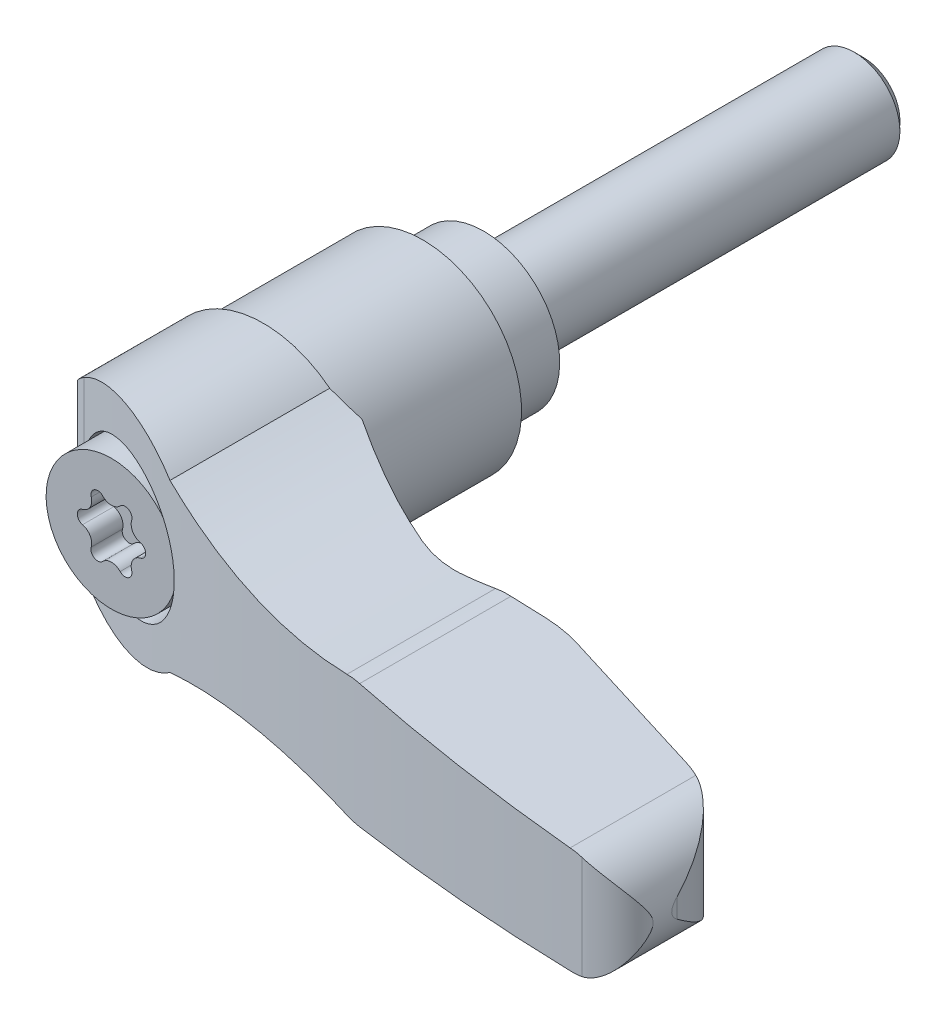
ISO-10303-21;
HEADER;
FILE_DESCRIPTION(('STEP AP214'),'2;1');
FILE_NAME('part.step','',(''),(''),'','','');
FILE_SCHEMA(('AUTOMOTIVE_DESIGN { 1 0 10303 214 1 1 1 1 }'));
ENDSEC;
DATA;
#1=APPLICATION_CONTEXT('core data for automotive mechanical design processes');
#2=APPLICATION_PROTOCOL_DEFINITION('international standard','automotive_design',2000,#1);
#3=PRODUCT_CONTEXT('',#1,'mechanical');
#4=PRODUCT('Part','Part','',(#3));
#5=PRODUCT_RELATED_PRODUCT_CATEGORY('part','',(#4));
#6=PRODUCT_DEFINITION_FORMATION('','',#4);
#7=PRODUCT_DEFINITION_CONTEXT('part definition',#1,'design');
#8=PRODUCT_DEFINITION('design','',#6,#7);
#9=PRODUCT_DEFINITION_SHAPE('','',#8);
#10=(LENGTH_UNIT() NAMED_UNIT(*) SI_UNIT(.MILLI.,.METRE.));
#11=(NAMED_UNIT(*) PLANE_ANGLE_UNIT() SI_UNIT($,.RADIAN.));
#12=(NAMED_UNIT(*) SI_UNIT($,.STERADIAN.) SOLID_ANGLE_UNIT());
#13=UNCERTAINTY_MEASURE_WITH_UNIT(LENGTH_MEASURE(1.E-05),#10,'distance_accuracy_value','');
#14=(GEOMETRIC_REPRESENTATION_CONTEXT(3) GLOBAL_UNCERTAINTY_ASSIGNED_CONTEXT((#13)) GLOBAL_UNIT_ASSIGNED_CONTEXT((#10,
#11,#12)) REPRESENTATION_CONTEXT('',''));
#15=CARTESIAN_POINT('',(0.,0.,0.));
#16=DIRECTION('',(0.,0.,1.));
#17=DIRECTION('',(1.,0.,0.));
#18=AXIS2_PLACEMENT_3D('',#15,#16,#17);
#19=CARTESIAN_POINT('',(0.,0.,-4.6928325));
#20=DIRECTION('',(0.,0.,-1.));
#21=DIRECTION('',(0.,1.,0.));
#22=AXIS2_PLACEMENT_3D('',#19,#20,#21);
#23=CYLINDRICAL_SURFACE('',#22,3.);
#24=CARTESIAN_POINT('',(0.,0.,-24.39));
#25=DIRECTION('',(0.,0.,-1.));
#26=DIRECTION('',(0.,1.,0.));
#27=AXIS2_PLACEMENT_3D('',#24,#25,#26);
#28=CIRCLE('',#27,3.);
#29=CARTESIAN_POINT('',(0.,3.,-24.39));
#30=VERTEX_POINT('',#29);
#31=EDGE_CURVE('E9',#30,#30,#28,.F.);
#32=ORIENTED_EDGE('',*,*,#31,.T.);
#33=EDGE_LOOP('',(#32));
#34=FACE_BOUND('',#33,.T.);
#35=CARTESIAN_POINT('',(0.,0.,0.));
#36=DIRECTION('',(0.,0.,-1.));
#37=DIRECTION('',(0.,1.,0.));
#38=AXIS2_PLACEMENT_3D('',#35,#36,#37);
#39=CIRCLE('',#38,3.);
#40=CARTESIAN_POINT('',(0.,3.,0.));
#41=VERTEX_POINT('',#40);
#42=EDGE_CURVE('E565',#41,#41,#39,.F.);
#43=ORIENTED_EDGE('',*,*,#42,.F.);
#44=EDGE_LOOP('',(#43));
#45=FACE_BOUND('',#44,.T.);
#46=ADVANCED_FACE('F14',(#34,#45),#23,.T.);
#47=CARTESIAN_POINT('',(4.,0.,0.));
#48=DIRECTION('',(0.,0.,-1.));
#49=DIRECTION('',(0.,1.,0.));
#50=AXIS2_PLACEMENT_3D('',#47,#48,#49);
#51=PLANE('',#50);
#52=ORIENTED_EDGE('',*,*,#42,.T.);
#53=EDGE_LOOP('',(#52));
#54=FACE_BOUND('',#53,.T.);
#55=CARTESIAN_POINT('',(0.,0.,0.));
#56=DIRECTION('',(0.,0.,-1.));
#57=DIRECTION('',(0.,1.,0.));
#58=AXIS2_PLACEMENT_3D('',#55,#56,#57);
#59=CIRCLE('',#58,5.);
#60=CARTESIAN_POINT('',(0.,5.,0.));
#61=VERTEX_POINT('',#60);
#62=EDGE_CURVE('E725',#61,#61,#59,.F.);
#63=ORIENTED_EDGE('',*,*,#62,.F.);
#64=EDGE_LOOP('',(#63));
#65=FACE_BOUND('',#64,.T.);
#66=ADVANCED_FACE('F668',(#54,#65),#51,.T.);
#67=CARTESIAN_POINT('',(0.,0.,6.4));
#68=DIRECTION('',(0.,0.,-1.));
#69=DIRECTION('',(0.,1.,0.));
#70=AXIS2_PLACEMENT_3D('',#67,#68,#69);
#71=CYLINDRICAL_SURFACE('',#70,5.);
#72=ORIENTED_EDGE('',*,*,#62,.T.);
#73=EDGE_LOOP('',(#72));
#74=FACE_BOUND('',#73,.T.);
#75=CARTESIAN_POINT('',(0.,0.,4.55000000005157));
#76=DIRECTION('',(0.,0.,-1.));
#77=DIRECTION('',(1.,0.,0.));
#78=AXIS2_PLACEMENT_3D('',#75,#76,#77);
#79=CIRCLE('',#78,4.99999999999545);
#80=CARTESIAN_POINT('',(4.99999999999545,0.,4.55000000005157));
#81=VERTEX_POINT('',#80);
#82=EDGE_CURVE('E558',#81,#81,#79,.T.);
#83=ORIENTED_EDGE('',*,*,#82,.T.);
#84=EDGE_LOOP('',(#83));
#85=FACE_BOUND('',#84,.T.);
#86=ADVANCED_FACE('F675',(#74,#85),#71,.T.);
#87=CARTESIAN_POINT('',(0.,0.,4.30000000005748));
#88=DIRECTION('',(0.,0.,-1.));
#89=DIRECTION('',(0.,1.,0.));
#90=AXIS2_PLACEMENT_3D('',#87,#88,#89);
#91=CONICAL_SURFACE('',#90,5.24999999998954,0.785398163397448);
#92=ORIENTED_EDGE('',*,*,#82,.F.);
#93=EDGE_LOOP('',(#92));
#94=FACE_BOUND('',#93,.T.);
#95=CARTESIAN_POINT('',(0.,0.,4.3));
#96=DIRECTION('',(0.,0.,-1.));
#97=DIRECTION('',(0.,1.,0.));
#98=AXIS2_PLACEMENT_3D('',#95,#96,#97);
#99=CIRCLE('',#98,5.25);
#100=CARTESIAN_POINT('',(0.,5.25,4.3));
#101=VERTEX_POINT('',#100);
#102=EDGE_CURVE('E554',#101,#101,#99,.T.);
#103=ORIENTED_EDGE('',*,*,#102,.T.);
#104=EDGE_LOOP('',(#103));
#105=FACE_BOUND('',#104,.T.);
#106=ADVANCED_FACE('F683',(#94,#105),#91,.F.);
#107=CARTESIAN_POINT('',(0.,0.,3.65));
#108=DIRECTION('',(0.,0.,-1.));
#109=DIRECTION('',(0.,1.,0.));
#110=AXIS2_PLACEMENT_3D('',#107,#108,#109);
#111=CYLINDRICAL_SURFACE('',#110,5.25);
#112=ORIENTED_EDGE('',*,*,#102,.F.);
#113=EDGE_LOOP('',(#112));
#114=FACE_BOUND('',#113,.T.);
#115=CARTESIAN_POINT('',(0.,0.,4.));
#116=DIRECTION('',(0.,0.,-1.));
#117=DIRECTION('',(0.,1.,0.));
#118=AXIS2_PLACEMENT_3D('',#115,#116,#117);
#119=CIRCLE('',#118,5.25);
#120=CARTESIAN_POINT('',(0.,5.25,4.));
#121=VERTEX_POINT('',#120);
#122=EDGE_CURVE('E713',#121,#121,#119,.F.);
#123=ORIENTED_EDGE('',*,*,#122,.F.);
#124=EDGE_LOOP('',(#123));
#125=FACE_BOUND('',#124,.T.);
#126=ADVANCED_FACE('F690',(#114,#125),#111,.F.);
#127=CARTESIAN_POINT('',(-6.36002265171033,-14.,4.));
#128=DIRECTION('',(0.707106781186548,0.,0.707106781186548));
#129=DIRECTION('',(-0.707106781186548,0.,0.707106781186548));
#130=AXIS2_PLACEMENT_3D('',#127,#128,#129);
#131=PLANE('',#130);
#132=DIRECTION('',(0.,1.,0.));
#133=VECTOR('',#132,1.);
#134=CARTESIAN_POINT('',(-6.36002265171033,0.,4.));
#135=LINE('',#134,#133);
#136=CARTESIAN_POINT('',(-6.36002265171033,-1.38824072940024,4.));
#137=VERTEX_POINT('',#136);
#138=CARTESIAN_POINT('',(-6.36002265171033,1.38824072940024,4.));
#139=VERTEX_POINT('',#138);
#140=EDGE_CURVE('E715',#137,#139,#135,.T.);
#141=ORIENTED_EDGE('',*,*,#140,.F.);
#142=CARTESIAN_POINT('',(-0.0100000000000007,0.,-2.35002265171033));
#143=DIRECTION('',(0.707106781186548,0.,0.707106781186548));
#144=DIRECTION('',(-0.707106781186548,0.,0.707106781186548));
#145=AXIS2_PLACEMENT_3D('',#142,#143,#144);
#146=ELLIPSE('',#145,9.19238815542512,6.5);
#147=EDGE_CURVE('E557',#139,#137,#146,.T.);
#148=ORIENTED_EDGE('',*,*,#147,.F.);
#149=EDGE_LOOP('',(#141,#148));
#150=FACE_BOUND('',#149,.T.);
#151=ADVANCED_FACE('F694',(#150),#131,.F.);
#152=CARTESIAN_POINT('',(-3.26,0.,4.));
#153=DIRECTION('',(0.,0.,-1.));
#154=DIRECTION('',(0.,1.,0.));
#155=AXIS2_PLACEMENT_3D('',#152,#153,#154);
#156=PLANE('',#155);
#157=CARTESIAN_POINT('',(-0.00999999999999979,0.,4.));
#158=DIRECTION('',(0.,0.,1.));
#159=DIRECTION('',(-1.,0.,0.));
#160=AXIS2_PLACEMENT_3D('',#157,#158,#159);
#161=CIRCLE('',#160,6.5);
#162=EDGE_CURVE('E709',#137,#139,#161,.T.);
#163=ORIENTED_EDGE('',*,*,#162,.F.);
#164=ORIENTED_EDGE('',*,*,#140,.T.);
#165=EDGE_LOOP('',(#163,#164));
#166=FACE_BOUND('',#165,.T.);
#167=ORIENTED_EDGE('',*,*,#122,.T.);
#168=EDGE_LOOP('',(#167));
#169=FACE_BOUND('',#168,.T.);
#170=ADVANCED_FACE('F697',(#166,#169),#156,.T.);
#171=CARTESIAN_POINT('',(39.9389658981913,-8.,27.2042491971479));
#172=DIRECTION('',(0.989626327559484,0.,-0.143665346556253));
#173=DIRECTION('',(0.143665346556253,0.,0.989626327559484));
#174=AXIS2_PLACEMENT_3D('',#171,#172,#173);
#175=PLANE('',#174);
#176=CARTESIAN_POINT('',(36.5,0.,3.51522972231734));
#177=DIRECTION('',(0.989626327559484,0.,-0.143665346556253));
#178=DIRECTION('',(0.143665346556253,0.,0.989626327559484));
#179=AXIS2_PLACEMENT_3D('',#176,#177,#178);
#180=ELLIPSE('',#179,24.3621728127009,3.5);
#181=CARTESIAN_POINT('',(39.9389658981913,-0.650779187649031,27.2042491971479));
#182=VERTEX_POINT('',#181);
#183=CARTESIAN_POINT('',(39.9389658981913,0.650779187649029,27.2042491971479));
#184=VERTEX_POINT('',#183);
#185=EDGE_CURVE('E461',#182,#184,#180,.F.);
#186=ORIENTED_EDGE('',*,*,#185,.F.);
#187=DIRECTION('',(0.,-1.,0.));
#188=VECTOR('',#187,1.);
#189=CARTESIAN_POINT('',(39.9389658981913,-8.,27.2042491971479));
#190=LINE('',#189,#188);
#191=EDGE_CURVE('E848',#184,#182,#190,.T.);
#192=ORIENTED_EDGE('',*,*,#191,.F.);
#193=EDGE_LOOP('',(#186,#192));
#194=FACE_BOUND('',#193,.T.);
#195=ADVANCED_FACE('F485',(#194),#175,.T.);
#196=CARTESIAN_POINT('',(33.8626602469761,-8.,28.0863544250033));
#197=DIRECTION('',(0.,-1.,0.));
#198=DIRECTION('',(1.,0.,0.));
#199=AXIS2_PLACEMENT_3D('',#196,#197,#198);
#200=CYLINDRICAL_SURFACE('',#199,6.14);
#201=ORIENTED_EDGE('',*,*,#191,.T.);
#202=CARTESIAN_POINT('',(36.5,-3.5,22.5416236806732));
#203=CARTESIAN_POINT('',(36.6061539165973,-3.50000941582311,22.5920863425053));
#204=CARTESIAN_POINT('',(36.7107657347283,-3.49517280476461,22.6456099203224));
#205=CARTESIAN_POINT('',(36.9160027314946,-3.47671082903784,22.758101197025));
#206=CARTESIAN_POINT('',(37.0166343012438,-3.46310021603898,22.8170596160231));
#207=CARTESIAN_POINT('',(37.2123479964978,-3.42816986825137,22.9392782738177));
#208=CARTESIAN_POINT('',(37.3074768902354,-3.40693163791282,23.002487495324));
#209=CARTESIAN_POINT('',(37.4929223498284,-3.3575759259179,23.13320682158));
#210=CARTESIAN_POINT('',(37.5832363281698,-3.32945478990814,23.2007191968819));
#211=CARTESIAN_POINT('',(37.7830795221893,-3.25850520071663,23.358740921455));
#212=CARTESIAN_POINT('',(37.8909927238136,-3.21376078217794,23.4504360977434));
#213=CARTESIAN_POINT('',(38.0982482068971,-3.11588681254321,23.6389903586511));
#214=CARTESIAN_POINT('',(38.1975840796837,-3.06275107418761,23.7358532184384));
#215=CARTESIAN_POINT('',(38.3880468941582,-2.94917464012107,23.9343090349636));
#216=CARTESIAN_POINT('',(38.4791322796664,-2.88870020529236,24.0359224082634));
#217=CARTESIAN_POINT('',(38.6526412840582,-2.76182607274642,24.2426721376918));
#218=CARTESIAN_POINT('',(38.7350674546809,-2.69542813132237,24.3478074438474));
#219=CARTESIAN_POINT('',(38.9229341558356,-2.52996933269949,24.6038856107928));
#220=CARTESIAN_POINT('',(39.0243159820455,-2.42850340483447,24.7562617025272));
#221=CARTESIAN_POINT('',(39.2111706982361,-2.21796613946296,25.0654781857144));
#222=CARTESIAN_POINT('',(39.2966363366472,-2.10889136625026,25.2223205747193));
#223=CARTESIAN_POINT('',(39.452222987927,-1.88493092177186,25.5392893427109));
#224=CARTESIAN_POINT('',(39.5223498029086,-1.77004746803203,25.699414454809));
#225=CARTESIAN_POINT('',(39.6478320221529,-1.53583460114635,26.0220530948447));
#226=CARTESIAN_POINT('',(39.7031929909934,-1.41650688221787,26.1845656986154));
#227=CARTESIAN_POINT('',(39.7933776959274,-1.1901857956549,26.4900634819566));
#228=CARTESIAN_POINT('',(39.8299343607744,-1.08360162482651,26.6328455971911));
#229=CARTESIAN_POINT('',(39.8923391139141,-0.86858691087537,26.918504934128));
#230=CARTESIAN_POINT('',(39.918226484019,-0.76016469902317,27.0613798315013));
#231=CARTESIAN_POINT('',(39.9389658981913,-0.650779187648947,27.204249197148));
#232=B_SPLINE_CURVE_WITH_KNOTS('',3,(#202,#203,#204,#205,#206,#207,#208,#209,#210,#211,#212,
#213,#214,#215,#216,#217,#218,#219,#220,#221,#222,#223,#224,#225,#226,#227,#228,#229,#230,#231),
.UNSPECIFIED.,.F.,.F.,(4,2,2,2,2,2,2,2,2,2,2,2,2,2,4),(0.,0.352350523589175,0.704110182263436,
1.05221781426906,1.40051067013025,1.84538152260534,2.29058194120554,2.73791274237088,
3.18511134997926,3.81198117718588,4.43913591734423,5.06605301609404,5.69273352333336,
6.23807905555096,6.78139842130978),.UNSPECIFIED.);
#233=CARTESIAN_POINT('',(36.5,-3.5,22.5416236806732));
#234=VERTEX_POINT('',#233);
#235=EDGE_CURVE('E465',#234,#182,#232,.T.);
#236=ORIENTED_EDGE('',*,*,#235,.F.);
#237=CARTESIAN_POINT('',(33.8626602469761,-3.59762871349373,28.0863544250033));
#238=DIRECTION('',(-0.0369925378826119,0.999315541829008,0.));
#239=DIRECTION('',(-0.999315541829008,-0.0369925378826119,0.));
#240=AXIS2_PLACEMENT_3D('',#237,#238,#239);
#241=ELLIPSE('',#240,6.14420545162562,6.14);
#242=CARTESIAN_POINT('',(35.5344609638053,-3.53574220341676,22.1783359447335));
#243=VERTEX_POINT('',#242);
#244=EDGE_CURVE('E717',#234,#243,#241,.T.);
#245=ORIENTED_EDGE('',*,*,#244,.T.);
#246=DIRECTION('',(0.,-1.,0.));
#247=VECTOR('',#246,1.);
#248=CARTESIAN_POINT('',(35.5344609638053,-8.,22.1783359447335));
#249=LINE('',#248,#247);
#250=CARTESIAN_POINT('',(35.5344609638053,3.53574220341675,22.1783359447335));
#251=VERTEX_POINT('',#250);
#252=EDGE_CURVE('E539',#251,#243,#249,.T.);
#253=ORIENTED_EDGE('',*,*,#252,.F.);
#254=CARTESIAN_POINT('',(33.8626602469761,3.59762871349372,28.0863544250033));
#255=DIRECTION('',(-0.036992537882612,-0.999315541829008,0.));
#256=DIRECTION('',(0.999315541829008,-0.036992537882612,0.));
#257=AXIS2_PLACEMENT_3D('',#254,#255,#256);
#258=ELLIPSE('',#257,6.14420545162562,6.14);
#259=CARTESIAN_POINT('',(36.5,3.5,22.5416236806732));
#260=VERTEX_POINT('',#259);
#261=EDGE_CURVE('E847',#251,#260,#258,.T.);
#262=ORIENTED_EDGE('',*,*,#261,.T.);
#263=CARTESIAN_POINT('',(39.9389658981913,0.65077918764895,27.204249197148));
#264=CARTESIAN_POINT('',(39.9247028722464,0.726086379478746,27.1059853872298));
#265=CARTESIAN_POINT('',(39.9079968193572,0.800887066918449,27.0076860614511));
#266=CARTESIAN_POINT('',(39.8696347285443,0.949458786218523,26.8112602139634));
#267=CARTESIAN_POINT('',(39.8479781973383,1.02322971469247,26.7131337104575));
#268=CARTESIAN_POINT('',(39.7995979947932,1.169880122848,26.5170899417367));
#269=CARTESIAN_POINT('',(39.7728626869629,1.24275713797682,26.4191736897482));
#270=CARTESIAN_POINT('',(39.7142815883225,1.38725410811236,26.2239599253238));
#271=CARTESIAN_POINT('',(39.6824358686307,1.4588740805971,26.1266624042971));
#272=CARTESIAN_POINT('',(39.5782917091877,1.67318502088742,25.8337016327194));
#273=CARTESIAN_POINT('',(39.4979263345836,1.81366367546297,25.6391889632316));
#274=CARTESIAN_POINT('',(39.3150854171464,2.08619457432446,25.2551202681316));
#275=CARTESIAN_POINT('',(39.2126344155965,2.218255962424,25.0655590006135));
#276=CARTESIAN_POINT('',(38.9595027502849,2.49877334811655,24.6523338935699));
#277=CARTESIAN_POINT('',(38.8031801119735,2.64456339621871,24.4302018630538));
#278=CARTESIAN_POINT('',(38.5417124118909,2.84488994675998,24.1082756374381));
#279=CARTESIAN_POINT('',(38.4501831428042,2.90854134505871,24.0029632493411));
#280=CARTESIAN_POINT('',(38.2579442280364,3.02861213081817,23.7967186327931));
#281=CARTESIAN_POINT('',(38.1572360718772,3.08503268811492,23.6957856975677));
#282=CARTESIAN_POINT('',(37.8892625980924,3.21757634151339,23.4457323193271));
#283=CARTESIAN_POINT('',(37.7155213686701,3.28779061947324,23.3001643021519));
#284=CARTESIAN_POINT('',(37.4396992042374,3.37286339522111,23.0946053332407));
#285=CARTESIAN_POINT('',(37.3453175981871,3.39783246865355,23.0282732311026));
#286=CARTESIAN_POINT('',(37.1517842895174,3.44019984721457,22.9003457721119));
#287=CARTESIAN_POINT('',(37.0526354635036,3.45760265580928,22.8387476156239));
#288=CARTESIAN_POINT('',(36.8781783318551,3.48029211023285,22.7372021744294));
#289=CARTESIAN_POINT('',(36.8038676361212,3.48759914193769,22.6959814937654));
#290=CARTESIAN_POINT('',(36.6533047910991,3.497455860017,22.6165121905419));
#291=CARTESIAN_POINT('',(36.5770513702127,3.50000234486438,22.5782655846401));
#292=CARTESIAN_POINT('',(36.5,3.5,22.5416236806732));
#293=B_SPLINE_CURVE_WITH_KNOTS('',3,(#263,#264,#265,#266,#267,#268,#269,#270,#271,#272,#273,
#274,#275,#276,#277,#278,#279,#280,#281,#282,#283,#284,#285,#286,#287,#288,#289,#290,#291,#292),
.UNSPECIFIED.,.F.,.F.,(4,2,2,2,2,2,2,2,2,2,2,2,2,2,4),(0.,0.373839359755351,0.747715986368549,
1.12245980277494,1.49719840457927,2.25512351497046,3.01221072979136,3.93367725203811,
4.39332639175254,4.85290107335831,5.56171222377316,5.91546495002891,6.26900683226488,
6.52468766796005,6.78054039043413),.UNSPECIFIED.);
#294=EDGE_CURVE('E434',#184,#260,#293,.T.);
#295=ORIENTED_EDGE('',*,*,#294,.F.);
#296=EDGE_LOOP('',(#201,#236,#245,#253,#262,#295));
#297=FACE_BOUND('',#296,.T.);
#298=ADVANCED_FACE('F479',(#297),#200,.T.);
#299=CARTESIAN_POINT('',(-0.0099999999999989,0.,10.28125));
#300=DIRECTION('',(0.,0.,1.));
#301=DIRECTION('',(-1.,0.,0.));
#302=AXIS2_PLACEMENT_3D('',#299,#300,#301);
#303=CYLINDRICAL_SURFACE('',#302,6.5);
#304=CARTESIAN_POINT('',(-0.00999999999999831,0.,14.5));
#305=DIRECTION('',(0.,0.,1.));
#306=DIRECTION('',(-1.,0.,0.));
#307=AXIS2_PLACEMENT_3D('',#304,#305,#306);
#308=CIRCLE('',#307,6.5);
#309=CARTESIAN_POINT('',(-6.51,0.,14.5));
#310=VERTEX_POINT('',#309);
#311=CARTESIAN_POINT('',(6.49,0.,14.5));
#312=VERTEX_POINT('',#311);
#313=EDGE_CURVE('E850',#310,#312,#308,.T.);
#314=ORIENTED_EDGE('',*,*,#313,.F.);
#315=CARTESIAN_POINT('',(-0.00999999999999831,0.,14.5));
#316=DIRECTION('',(0.,0.,1.));
#317=DIRECTION('',(-1.,0.,0.));
#318=AXIS2_PLACEMENT_3D('',#315,#316,#317);
#319=CIRCLE('',#318,6.5);
#320=EDGE_CURVE('E536',#312,#310,#319,.T.);
#321=ORIENTED_EDGE('',*,*,#320,.F.);
#322=EDGE_LOOP('',(#314,#321));
#323=FACE_BOUND('',#322,.T.);
#324=ORIENTED_EDGE('',*,*,#162,.T.);
#325=ORIENTED_EDGE('',*,*,#147,.T.);
#326=EDGE_LOOP('',(#324,#325));
#327=FACE_BOUND('',#326,.T.);
#328=ADVANCED_FACE('F484',(#323,#327),#303,.T.);
#329=CARTESIAN_POINT('',(-6.51,-8.,14.5));
#330=DIRECTION('',(0.,0.,-1.));
#331=DIRECTION('',(0.,1.,0.));
#332=AXIS2_PLACEMENT_3D('',#329,#330,#331);
#333=PLANE('',#332);
#334=ORIENTED_EDGE('',*,*,#313,.T.);
#335=DIRECTION('',(0.,-1.,0.));
#336=VECTOR('',#335,1.);
#337=CARTESIAN_POINT('',(6.49,-8.,14.5));
#338=LINE('',#337,#336);
#339=CARTESIAN_POINT('',(6.49,-4.77390244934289,14.5));
#340=VERTEX_POINT('',#339);
#341=EDGE_CURVE('E853',#312,#340,#338,.T.);
#342=ORIENTED_EDGE('',*,*,#341,.T.);
#343=CARTESIAN_POINT('',(14.8,-33.6,14.5));
#344=DIRECTION('',(0.,0.,1.));
#345=DIRECTION('',(0.,-1.,0.));
#346=AXIS2_PLACEMENT_3D('',#343,#344,#345);
#347=CIRCLE('',#346,30.);
#348=CARTESIAN_POINT('',(4.36278582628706,-5.47413005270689,14.5));
#349=VERTEX_POINT('',#348);
#350=EDGE_CURVE('E810',#340,#349,#347,.T.);
#351=ORIENTED_EDGE('',*,*,#350,.T.);
#352=CARTESIAN_POINT('',(0.,0.,14.5));
#353=DIRECTION('',(0.,0.,1.));
#354=DIRECTION('',(0.,-1.,0.));
#355=AXIS2_PLACEMENT_3D('',#352,#353,#354);
#356=CIRCLE('',#355,7.);
#357=CARTESIAN_POINT('',(-6.51,-2.57291663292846,14.5));
#358=VERTEX_POINT('',#357);
#359=EDGE_CURVE('E372',#358,#349,#356,.T.);
#360=ORIENTED_EDGE('',*,*,#359,.F.);
#361=DIRECTION('',(0.,-1.,0.));
#362=VECTOR('',#361,1.);
#363=CARTESIAN_POINT('',(-6.51,-8.,14.5));
#364=LINE('',#363,#362);
#365=EDGE_CURVE('E535',#310,#358,#364,.T.);
#366=ORIENTED_EDGE('',*,*,#365,.F.);
#367=EDGE_LOOP('',(#334,#342,#351,#360,#366));
#368=FACE_BOUND('',#367,.T.);
#369=ADVANCED_FACE('F490',(#368),#333,.T.);
#370=CARTESIAN_POINT('',(20.6060580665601,0.915064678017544,31.));
#371=DIRECTION('',(0.,0.,1.));
#372=DIRECTION('',(0.,-1.,0.));
#373=AXIS2_PLACEMENT_3D('',#370,#371,#372);
#374=CYLINDRICAL_SURFACE('',#373,5.);
#375=CARTESIAN_POINT('',(20.7910207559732,-4.08151303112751,28.9575923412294));
#376=CARTESIAN_POINT('',(20.6207575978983,-4.08776311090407,28.9275070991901));
#377=CARTESIAN_POINT('',(20.4510927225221,-4.08540030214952,28.8972050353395));
#378=CARTESIAN_POINT('',(20.1129595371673,-4.06344890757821,28.8361672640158));
#379=CARTESIAN_POINT('',(19.9444912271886,-4.04386032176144,28.8054315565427));
#380=CARTESIAN_POINT('',(19.7766211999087,-4.01565884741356,28.7744790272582));
#381=B_SPLINE_CURVE_WITH_KNOTS('',3,(#375,#376,#377,#378,#379,#380),.UNSPECIFIED.,.F.,.F.,(4,2,
4),(0.,0.517097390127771,1.03419478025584),.UNSPECIFIED.);
#382=CARTESIAN_POINT('',(20.7910207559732,-4.08151303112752,28.9575923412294));
#383=VERTEX_POINT('',#382);
#384=CARTESIAN_POINT('',(19.7766211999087,-4.01565884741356,28.7744790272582));
#385=VERTEX_POINT('',#384);
#386=EDGE_CURVE('E468',#383,#385,#381,.T.);
#387=ORIENTED_EDGE('',*,*,#386,.T.);
#388=DIRECTION('',(0.,0.,1.));
#389=VECTOR('',#388,1.);
#390=CARTESIAN_POINT('',(19.7766211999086,-4.01565884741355,31.));
#391=LINE('',#390,#389);
#392=CARTESIAN_POINT('',(19.7766211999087,-4.01565884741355,19.));
#393=VERTEX_POINT('',#392);
#394=EDGE_CURVE('E803',#385,#393,#391,.F.);
#395=ORIENTED_EDGE('',*,*,#394,.T.);
#396=CARTESIAN_POINT('',(20.6060580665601,0.915064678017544,19.));
#397=DIRECTION('',(0.,0.,1.));
#398=DIRECTION('',(0.,-1.,0.));
#399=AXIS2_PLACEMENT_3D('',#396,#397,#398);
#400=CIRCLE('',#399,5.);
#401=CARTESIAN_POINT('',(20.7910207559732,-4.08151303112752,19.));
#402=VERTEX_POINT('',#401);
#403=EDGE_CURVE('E857',#402,#393,#400,.F.);
#404=ORIENTED_EDGE('',*,*,#403,.F.);
#405=DIRECTION('',(0.,0.,1.));
#406=VECTOR('',#405,1.);
#407=CARTESIAN_POINT('',(20.7910207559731,-4.08151303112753,31.));
#408=LINE('',#407,#406);
#409=EDGE_CURVE('E809',#402,#383,#408,.T.);
#410=ORIENTED_EDGE('',*,*,#409,.T.);
#411=EDGE_LOOP('',(#387,#395,#404,#410));
#412=FACE_BOUND('',#411,.T.);
#413=ADVANCED_FACE('F426',(#412),#374,.T.);
#414=CARTESIAN_POINT('',(36.5,0.,31.));
#415=DIRECTION('',(0.,0.,1.));
#416=DIRECTION('',(0.,-1.,0.));
#417=AXIS2_PLACEMENT_3D('',#414,#415,#416);
#418=CYLINDRICAL_SURFACE('',#417,3.5);
#419=CARTESIAN_POINT('',(37.3240183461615,-3.40161634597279,30.8631619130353));
#420=CARTESIAN_POINT('',(37.188603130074,-3.43435641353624,30.8557619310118));
#421=CARTESIAN_POINT('',(37.0522273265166,-3.45892508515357,30.8481012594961));
#422=CARTESIAN_POINT('',(36.7775545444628,-3.49171963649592,30.8322585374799));
#423=CARTESIAN_POINT('',(36.6392575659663,-3.499945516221,30.8240764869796));
#424=CARTESIAN_POINT('',(36.5,-3.5,30.815633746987));
#425=B_SPLINE_CURVE_WITH_KNOTS('',3,(#419,#420,#421,#422,#423,#424),.UNSPECIFIED.,.F.,.F.,(4,2,
4),(0.,0.416348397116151,0.832696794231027),.UNSPECIFIED.);
#426=CARTESIAN_POINT('',(37.3240183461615,-3.40161634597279,30.8631619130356));
#427=VERTEX_POINT('',#426);
#428=CARTESIAN_POINT('',(36.5,-3.5,30.815633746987));
#429=VERTEX_POINT('',#428);
#430=EDGE_CURVE('E446',#427,#429,#425,.T.);
#431=ORIENTED_EDGE('',*,*,#430,.T.);
#432=DIRECTION('',(0.,0.,1.));
#433=VECTOR('',#432,1.);
#434=CARTESIAN_POINT('',(36.5,-3.5,31.));
#435=LINE('',#434,#433);
#436=EDGE_CURVE('E820',#429,#234,#435,.F.);
#437=ORIENTED_EDGE('',*,*,#436,.T.);
#438=ORIENTED_EDGE('',*,*,#235,.T.);
#439=ORIENTED_EDGE('',*,*,#185,.T.);
#440=ORIENTED_EDGE('',*,*,#294,.T.);
#441=DIRECTION('',(0.,0.,1.));
#442=VECTOR('',#441,1.);
#443=CARTESIAN_POINT('',(36.5,3.5,31.));
#444=LINE('',#443,#442);
#445=CARTESIAN_POINT('',(36.5,3.5,30.815633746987));
#446=VERTEX_POINT('',#445);
#447=EDGE_CURVE('E414',#260,#446,#444,.T.);
#448=ORIENTED_EDGE('',*,*,#447,.T.);
#449=CARTESIAN_POINT('',(36.5,3.5,30.815633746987));
#450=CARTESIAN_POINT('',(36.6392575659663,3.499945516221,30.8240764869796));
#451=CARTESIAN_POINT('',(36.7775545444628,3.49171963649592,30.8322585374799));
#452=CARTESIAN_POINT('',(37.0522273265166,3.45892508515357,30.8481012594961));
#453=CARTESIAN_POINT('',(37.188603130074,3.43435641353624,30.8557619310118));
#454=CARTESIAN_POINT('',(37.3240183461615,3.40161634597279,30.8631619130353));
#455=B_SPLINE_CURVE_WITH_KNOTS('',3,(#449,#450,#451,#452,#453,#454),.UNSPECIFIED.,.F.,.F.,(4,2,
4),(0.,0.416348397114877,0.832696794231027),.UNSPECIFIED.);
#456=CARTESIAN_POINT('',(37.3240183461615,3.40161634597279,30.8631619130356));
#457=VERTEX_POINT('',#456);
#458=EDGE_CURVE('E452',#446,#457,#455,.T.);
#459=ORIENTED_EDGE('',*,*,#458,.T.);
#460=CARTESIAN_POINT('',(37.3240183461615,-3.40161634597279,30.8631619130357));
#461=CARTESIAN_POINT('',(37.391971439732,-3.38517327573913,30.8668921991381));
#462=CARTESIAN_POINT('',(37.4595366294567,-3.36663320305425,30.8678982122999));
#463=CARTESIAN_POINT('',(37.5932555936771,-3.32560440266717,30.8647814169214));
#464=CARTESIAN_POINT('',(37.6594109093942,-3.30312026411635,30.8606645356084));
#465=CARTESIAN_POINT('',(37.7892420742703,-3.25463078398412,30.8476880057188));
#466=CARTESIAN_POINT('',(37.8529349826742,-3.22865926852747,30.8388717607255));
#467=CARTESIAN_POINT('',(37.9780608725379,-3.17332967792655,30.8169101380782));
#468=CARTESIAN_POINT('',(38.0394932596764,-3.14397072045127,30.8037636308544));
#469=CARTESIAN_POINT('',(38.2193405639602,-3.05154774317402,30.7585650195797));
#470=CARTESIAN_POINT('',(38.3339861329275,-2.98387991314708,30.7206782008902));
#471=CARTESIAN_POINT('',(38.5517467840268,-2.83858348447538,30.6324207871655));
#472=CARTESIAN_POINT('',(38.6548343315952,-2.76093200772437,30.5820212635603));
#473=CARTESIAN_POINT('',(38.8266237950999,-2.61655584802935,30.4842690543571));
#474=CARTESIAN_POINT('',(38.8977926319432,-2.55140368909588,30.4388637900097));
#475=CARTESIAN_POINT('',(39.0330318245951,-2.41719472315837,30.3433991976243));
#476=CARTESIAN_POINT('',(39.0970985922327,-2.34813596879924,30.2933375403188));
#477=CARTESIAN_POINT('',(39.2184581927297,-2.20651617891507,30.1893556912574));
#478=CARTESIAN_POINT('',(39.2757265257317,-2.13394372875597,30.1354226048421));
#479=CARTESIAN_POINT('',(39.3834200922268,-1.9860149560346,30.0247265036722));
#480=CARTESIAN_POINT('',(39.4338475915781,-1.91065956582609,29.9679644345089));
#481=CARTESIAN_POINT('',(39.542421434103,-1.73419420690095,29.8348143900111));
#482=CARTESIAN_POINT('',(39.598263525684,-1.63221056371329,29.7576996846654));
#483=CARTESIAN_POINT('',(39.699250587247,-1.42414609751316,29.601672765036));
#484=CARTESIAN_POINT('',(39.7443776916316,-1.31805876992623,29.5227577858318));
#485=CARTESIAN_POINT('',(39.8239747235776,-1.10201279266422,29.3659397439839));
#486=CARTESIAN_POINT('',(39.8584944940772,-0.992075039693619,29.2880336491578));
#487=CARTESIAN_POINT('',(39.9024720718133,-0.82253324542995,29.1754655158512));
#488=CARTESIAN_POINT('',(39.9158188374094,-0.765322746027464,29.13870216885));
#489=CARTESIAN_POINT('',(39.9398686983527,-0.648731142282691,29.0678855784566));
#490=CARTESIAN_POINT('',(39.9505741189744,-0.589352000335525,29.0338299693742));
#491=CARTESIAN_POINT('',(39.9677206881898,-0.477086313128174,28.9756719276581));
#492=CARTESIAN_POINT('',(39.974567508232,-0.424644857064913,28.9508463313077));
#493=CARTESIAN_POINT('',(39.9860225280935,-0.317100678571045,28.907341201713));
#494=CARTESIAN_POINT('',(39.9906385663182,-0.262008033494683,28.8886402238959));
#495=CARTESIAN_POINT('',(39.9966232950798,-0.160247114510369,28.8637621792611));
#496=CARTESIAN_POINT('',(39.9984523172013,-0.114054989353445,28.8558445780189));
#497=CARTESIAN_POINT('',(40.0002450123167,-0.0209847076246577,28.8480882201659));
#498=CARTESIAN_POINT('',(40.0002117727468,0.0258921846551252,28.8482360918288));
#499=CARTESIAN_POINT('',(39.9982952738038,0.118672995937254,28.8565205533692));
#500=CARTESIAN_POINT('',(39.9964185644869,0.164579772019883,28.8646288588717));
#501=CARTESIAN_POINT('',(39.9910078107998,0.254792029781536,28.8870889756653));
#502=CARTESIAN_POINT('',(39.9874686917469,0.299092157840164,28.9014598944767));
#503=CARTESIAN_POINT('',(39.9768286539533,0.407331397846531,28.9425912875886));
#504=CARTESIAN_POINT('',(39.9688318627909,0.470155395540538,28.9719647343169));
#505=CARTESIAN_POINT('',(39.9499914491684,0.592804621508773,29.0357410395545));
#506=CARTESIAN_POINT('',(39.9391403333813,0.652621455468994,29.0701570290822));
#507=CARTESIAN_POINT('',(39.9146680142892,0.770512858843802,29.1419527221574));
#508=CARTESIAN_POINT('',(39.9010255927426,0.828569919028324,29.1793537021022));
#509=CARTESIAN_POINT('',(39.8711029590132,0.942947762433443,29.2555520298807));
#510=CARTESIAN_POINT('',(39.8548256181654,0.999270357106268,29.2943478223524));
#511=CARTESIAN_POINT('',(39.8016739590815,1.1674299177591,29.4125134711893));
#512=CARTESIAN_POINT('',(39.7607265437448,1.27728939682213,29.4929030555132));
#513=CARTESIAN_POINT('',(39.6677865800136,1.49294867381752,29.6529500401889));
#514=CARTESIAN_POINT('',(39.6157834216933,1.59874445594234,29.7326066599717));
#515=CARTESIAN_POINT('',(39.5005966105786,1.80564912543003,29.8886982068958));
#516=CARTESIAN_POINT('',(39.4374685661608,1.90677830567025,29.9651469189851));
#517=CARTESIAN_POINT('',(39.2994325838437,2.10420227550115,30.1133265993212));
#518=CARTESIAN_POINT('',(39.2245348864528,2.20050117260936,30.1850615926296));
#519=CARTESIAN_POINT('',(39.0442952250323,2.40820732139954,30.3372677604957));
#520=CARTESIAN_POINT('',(38.9358891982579,2.51819093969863,30.4161164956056));
#521=CARTESIAN_POINT('',(38.7000552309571,2.72661786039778,30.559662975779));
#522=CARTESIAN_POINT('',(38.5726400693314,2.82506883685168,30.6243701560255));
#523=CARTESIAN_POINT('',(38.3254291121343,2.98922527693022,30.7237895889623));
#524=CARTESIAN_POINT('',(38.2087731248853,3.05759969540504,30.7618633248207));
#525=CARTESIAN_POINT('',(37.9650872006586,3.18151973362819,30.8217517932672));
#526=CARTESIAN_POINT('',(37.8380870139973,3.23710049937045,30.8436114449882));
#527=CARTESIAN_POINT('',(37.6449762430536,3.3080955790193,30.8616374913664));
#528=CARTESIAN_POINT('',(37.5816159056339,3.32934954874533,30.8652564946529));
#529=CARTESIAN_POINT('',(37.4536360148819,3.36824327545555,30.867801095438));
#530=CARTESIAN_POINT('',(37.389015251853,3.38587935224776,30.8667219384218));
#531=CARTESIAN_POINT('',(37.3240183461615,3.40161634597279,30.8631619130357));
#532=B_SPLINE_CURVE_WITH_KNOTS('',3,(#460,#461,#462,#463,#464,#465,#466,#467,#468,#469,#470,
#471,#472,#473,#474,#475,#476,#477,#478,#479,#480,#481,#482,#483,#484,#485,#486,#487,#488,#489,
#490,#491,#492,#493,#494,#495,#496,#497,#498,#499,#500,#501,#502,#503,#504,#505,#506,#507,#508,
#509,#510,#511,#512,#513,#514,#515,#516,#517,#518,#519,#520,#521,#522,#523,#524,#525,#526,#527,
#528,#529,#530,#531),.UNSPECIFIED.,.F.,.F.,(4,2,2,2,2,2,2,2,2,2,2,2,2,2,2,2,2,2,2,2,2,2,2,2,2,2,
2,2,2,2,2,2,2,2,2,4),(0.,0.20991378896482,0.419584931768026,0.62735226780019,0.83517384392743,
1.2486492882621,1.66308971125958,1.98257890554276,2.30222878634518,2.62299771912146,
2.94366014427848,3.36167065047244,3.78037330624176,4.19707731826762,4.40489951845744,
4.61253810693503,4.78756393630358,4.9619702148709,5.10204921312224,5.24189598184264,
5.38124764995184,5.52102749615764,5.72989301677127,5.9393124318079,6.15038720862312,
6.36123350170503,6.7871576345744,7.21349237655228,7.63775356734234,8.06164764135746,
8.58013018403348,9.09826573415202,9.51811060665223,9.9367879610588,10.1373304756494,
10.3380759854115),.UNSPECIFIED.);
#533=EDGE_CURVE('E406',#427,#457,#532,.T.);
#534=ORIENTED_EDGE('',*,*,#533,.F.);
#535=EDGE_LOOP('',(#431,#437,#438,#439,#440,#448,#459,#534));
#536=FACE_BOUND('',#535,.T.);
#537=ADVANCED_FACE('F420',(#536),#418,.T.);
#538=CARTESIAN_POINT('',(23.0466685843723,-8.,28.05));
#539=DIRECTION('',(0.,-1.,0.));
#540=DIRECTION('',(1.,0.,0.));
#541=AXIS2_PLACEMENT_3D('',#538,#539,#540);
#542=CYLINDRICAL_SURFACE('',#541,9.05000000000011);
#543=CARTESIAN_POINT('',(23.0466685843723,3.99801374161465,28.05));
#544=DIRECTION('',(-0.036992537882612,-0.999315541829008,0.));
#545=DIRECTION('',(0.999315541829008,-0.036992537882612,0.));
#546=AXIS2_PLACEMENT_3D('',#543,#544,#545);
#547=ELLIPSE('',#546,9.05619858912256,9.05000000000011);
#548=CARTESIAN_POINT('',(23.0466685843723,3.99801374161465,19.));
#549=VERTEX_POINT('',#548);
#550=CARTESIAN_POINT('',(25.5108048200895,3.90679665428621,19.34192715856));
#551=VERTEX_POINT('',#550);
#552=EDGE_CURVE('E402',#549,#551,#547,.T.);
#553=ORIENTED_EDGE('',*,*,#552,.T.);
#554=DIRECTION('',(0.,-1.,0.));
#555=VECTOR('',#554,1.);
#556=CARTESIAN_POINT('',(25.5108048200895,-8.,19.34192715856));
#557=LINE('',#556,#555);
#558=CARTESIAN_POINT('',(25.5108048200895,-3.90679665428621,19.34192715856));
#559=VERTEX_POINT('',#558);
#560=EDGE_CURVE('E459',#559,#551,#557,.F.);
#561=ORIENTED_EDGE('',*,*,#560,.F.);
#562=CARTESIAN_POINT('',(23.0466685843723,-3.99801374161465,28.05));
#563=DIRECTION('',(-0.0369925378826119,0.999315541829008,0.));
#564=DIRECTION('',(-0.999315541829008,-0.0369925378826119,0.));
#565=AXIS2_PLACEMENT_3D('',#562,#563,#564);
#566=ELLIPSE('',#565,9.05619858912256,9.05000000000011);
#567=CARTESIAN_POINT('',(23.0466685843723,-3.99801374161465,19.));
#568=VERTEX_POINT('',#567);
#569=EDGE_CURVE('E416',#559,#568,#566,.T.);
#570=ORIENTED_EDGE('',*,*,#569,.T.);
#571=DIRECTION('',(0.,1.,0.));
#572=VECTOR('',#571,1.);
#573=CARTESIAN_POINT('',(23.0466685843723,-8.,19.));
#574=LINE('',#573,#572);
#575=EDGE_CURVE('E543',#549,#568,#574,.F.);
#576=ORIENTED_EDGE('',*,*,#575,.F.);
#577=EDGE_LOOP('',(#553,#561,#570,#576));
#578=FACE_BOUND('',#577,.T.);
#579=ADVANCED_FACE('F425',(#578),#542,.T.);
#580=CARTESIAN_POINT('',(25.5108048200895,-8.,19.34192715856));
#581=DIRECTION('',(0.272280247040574,0.,-0.962217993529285));
#582=DIRECTION('',(0.962217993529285,0.,0.272280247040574));
#583=AXIS2_PLACEMENT_3D('',#580,#581,#582);
#584=PLANE('',#583);
#585=DIRECTION('',(0.961608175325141,-0.0355966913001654,0.272107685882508));
#586=VECTOR('',#585,1.);
#587=CARTESIAN_POINT('',(25.5108048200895,3.90679665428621,19.34192715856));
#588=LINE('',#587,#586);
#589=EDGE_CURVE('E404',#551,#251,#588,.T.);
#590=ORIENTED_EDGE('',*,*,#589,.T.);
#591=ORIENTED_EDGE('',*,*,#252,.T.);
#592=DIRECTION('',(-0.961608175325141,-0.0355966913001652,-0.272107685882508));
#593=VECTOR('',#592,1.);
#594=CARTESIAN_POINT('',(35.5344609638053,-3.53574220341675,22.1783359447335));
#595=LINE('',#594,#593);
#596=EDGE_CURVE('E817',#243,#559,#595,.T.);
#597=ORIENTED_EDGE('',*,*,#596,.T.);
#598=ORIENTED_EDGE('',*,*,#560,.T.);
#599=EDGE_LOOP('',(#590,#591,#597,#598));
#600=FACE_BOUND('',#599,.T.);
#601=ADVANCED_FACE('F875',(#600),#584,.T.);
#602=CARTESIAN_POINT('',(20.60605806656,-0.915064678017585,31.));
#603=DIRECTION('',(0.,0.,1.));
#604=DIRECTION('',(0.,-1.,0.));
#605=AXIS2_PLACEMENT_3D('',#602,#603,#604);
#606=CYLINDRICAL_SURFACE('',#605,5.00000000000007);
#607=CARTESIAN_POINT('',(19.7766211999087,4.01565884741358,28.7744790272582));
#608=CARTESIAN_POINT('',(19.9444912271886,4.04386032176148,28.8054315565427));
#609=CARTESIAN_POINT('',(20.1129595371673,4.06344890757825,28.8361672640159));
#610=CARTESIAN_POINT('',(20.4510927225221,4.08540030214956,28.8972050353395));
#611=CARTESIAN_POINT('',(20.6207575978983,4.08776311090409,28.9275070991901));
#612=CARTESIAN_POINT('',(20.7910207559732,4.08151303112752,28.9575923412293));
#613=B_SPLINE_CURVE_WITH_KNOTS('',3,(#607,#608,#609,#610,#611,#612),.UNSPECIFIED.,.F.,.F.,(4,2,
4),(0.,0.517097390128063,1.03419478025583),.UNSPECIFIED.);
#614=CARTESIAN_POINT('',(19.7766211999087,4.01565884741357,28.7744790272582));
#615=VERTEX_POINT('',#614);
#616=CARTESIAN_POINT('',(20.7910207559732,4.08151303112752,28.9575923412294));
#617=VERTEX_POINT('',#616);
#618=EDGE_CURVE('E542',#615,#617,#613,.T.);
#619=ORIENTED_EDGE('',*,*,#618,.T.);
#620=DIRECTION('',(0.,0.,1.));
#621=VECTOR('',#620,1.);
#622=CARTESIAN_POINT('',(20.7910207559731,4.08151303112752,31.));
#623=LINE('',#622,#621);
#624=CARTESIAN_POINT('',(20.7910207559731,4.08151303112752,19.));
#625=VERTEX_POINT('',#624);
#626=EDGE_CURVE('E828',#617,#625,#623,.F.);
#627=ORIENTED_EDGE('',*,*,#626,.T.);
#628=CARTESIAN_POINT('',(20.60605806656,-0.915064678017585,19.));
#629=DIRECTION('',(0.,0.,1.));
#630=DIRECTION('',(0.,-1.,0.));
#631=AXIS2_PLACEMENT_3D('',#628,#629,#630);
#632=CIRCLE('',#631,5.00000000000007);
#633=CARTESIAN_POINT('',(19.7766211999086,4.01565884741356,19.));
#634=VERTEX_POINT('',#633);
#635=EDGE_CURVE('E547',#634,#625,#632,.F.);
#636=ORIENTED_EDGE('',*,*,#635,.F.);
#637=DIRECTION('',(0.,0.,1.));
#638=VECTOR('',#637,1.);
#639=CARTESIAN_POINT('',(19.7766211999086,4.01565884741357,31.));
#640=LINE('',#639,#638);
#641=EDGE_CURVE('E401',#634,#615,#640,.T.);
#642=ORIENTED_EDGE('',*,*,#641,.T.);
#643=EDGE_LOOP('',(#619,#627,#636,#642));
#644=FACE_BOUND('',#643,.T.);
#645=ADVANCED_FACE('F872',(#644),#606,.T.);
#646=CARTESIAN_POINT('',(42.8289340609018,-8.,-49.9630271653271));
#647=DIRECTION('',(0.,-1.,0.));
#648=DIRECTION('',(1.,0.,0.));
#649=AXIS2_PLACEMENT_3D('',#646,#647,#648);
#650=CYLINDRICAL_SURFACE('',#649,74.0000000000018);
#651=DIRECTION('',(0.,-1.,0.));
#652=VECTOR('',#651,1.);
#653=CARTESIAN_POINT('',(14.2560355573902,-8.,18.2981585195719));
#654=LINE('',#653,#652);
#655=CARTESIAN_POINT('',(14.2560355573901,3.60493202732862,18.2981585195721));
#656=VERTEX_POINT('',#655);
#657=CARTESIAN_POINT('',(14.2560355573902,-3.60493202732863,18.2981585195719));
#658=VERTEX_POINT('',#657);
#659=EDGE_CURVE('E855',#656,#658,#654,.T.);
#660=ORIENTED_EDGE('',*,*,#659,.T.);
#661=CARTESIAN_POINT('',(14.2560355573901,-3.60493202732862,18.2981585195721));
#662=CARTESIAN_POINT('',(13.91912090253,-3.61104217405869,18.1571345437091));
#663=CARTESIAN_POINT('',(13.5833701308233,-3.62280963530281,18.0136612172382));
#664=CARTESIAN_POINT('',(12.9145226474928,-3.65743626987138,17.7219861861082));
#665=CARTESIAN_POINT('',(12.5814258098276,-3.68029491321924,17.5737847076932));
#666=CARTESIAN_POINT('',(11.5893580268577,-3.7649360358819,17.1235938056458));
#667=CARTESIAN_POINT('',(10.9347595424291,-3.84283944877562,16.8148240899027));
#668=CARTESIAN_POINT('',(9.64003521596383,-4.03983028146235,16.1808788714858));
#669=CARTESIAN_POINT('',(8.99990836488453,-4.15891482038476,15.8557045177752));
#670=CARTESIAN_POINT('',(7.73340291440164,-4.43691869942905,15.1892512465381));
#671=CARTESIAN_POINT('',(7.10709183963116,-4.5960001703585,14.8479114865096));
#672=CARTESIAN_POINT('',(6.49,-4.77390244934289,14.5));
#673=B_SPLINE_CURVE_WITH_KNOTS('',3,(#661,#662,#663,#664,#665,#666,#667,#668,#669,#670,#671,
#672),.UNSPECIFIED.,.F.,.F.,(4,2,2,2,2,4),(0.,1.09575278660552,2.19145321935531,
4.37360080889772,6.55559577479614,8.74658240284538),.UNSPECIFIED.);
#674=EDGE_CURVE('E356',#658,#340,#673,.T.);
#675=ORIENTED_EDGE('',*,*,#674,.T.);
#676=ORIENTED_EDGE('',*,*,#341,.F.);
#677=DIRECTION('',(0.,1.,0.));
#678=VECTOR('',#677,1.);
#679=CARTESIAN_POINT('',(6.49,-8.,14.5));
#680=LINE('',#679,#678);
#681=CARTESIAN_POINT('',(6.49,4.77390244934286,14.5));
#682=VERTEX_POINT('',#681);
#683=EDGE_CURVE('E546',#682,#312,#680,.F.);
#684=ORIENTED_EDGE('',*,*,#683,.F.);
#685=CARTESIAN_POINT('',(6.49,4.77390244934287,14.5));
#686=CARTESIAN_POINT('',(7.10709183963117,4.59600017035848,14.8479114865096));
#687=CARTESIAN_POINT('',(7.73340291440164,4.43691869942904,15.1892512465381));
#688=CARTESIAN_POINT('',(8.99990836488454,4.15891482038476,15.8557045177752));
#689=CARTESIAN_POINT('',(9.64003521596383,4.03983028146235,16.1808788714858));
#690=CARTESIAN_POINT('',(10.9347595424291,3.84283944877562,16.8148240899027));
#691=CARTESIAN_POINT('',(11.5893580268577,3.7649360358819,17.1235938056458));
#692=CARTESIAN_POINT('',(12.5814258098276,3.68029491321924,17.5737847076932));
#693=CARTESIAN_POINT('',(12.9145226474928,3.65743626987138,17.7219861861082));
#694=CARTESIAN_POINT('',(13.5833701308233,3.62280963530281,18.0136612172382));
#695=CARTESIAN_POINT('',(13.91912090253,3.61104217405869,18.1571345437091));
#696=CARTESIAN_POINT('',(14.2560355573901,3.60493202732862,18.2981585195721));
#697=B_SPLINE_CURVE_WITH_KNOTS('',3,(#685,#686,#687,#688,#689,#690,#691,#692,#693,#694,#695,
#696),.UNSPECIFIED.,.F.,.F.,(4,2,2,2,2,4),(0.,2.19098662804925,4.37298159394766,
6.55512918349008,7.65082961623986,8.74658240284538),.UNSPECIFIED.);
#698=EDGE_CURVE('E392',#682,#656,#697,.T.);
#699=ORIENTED_EDGE('',*,*,#698,.T.);
#700=EDGE_LOOP('',(#660,#675,#676,#684,#699));
#701=FACE_BOUND('',#700,.T.);
#702=ADVANCED_FACE('F379',(#701),#650,.F.);
#703=CARTESIAN_POINT('',(17.7504238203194,-8.,9.95000000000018));
#704=DIRECTION('',(0.,-1.,0.));
#705=DIRECTION('',(1.,0.,0.));
#706=AXIS2_PLACEMENT_3D('',#703,#704,#705);
#707=CYLINDRICAL_SURFACE('',#706,9.04999999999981);
#708=ORIENTED_EDGE('',*,*,#659,.F.);
#709=CARTESIAN_POINT('',(14.2560355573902,3.60493202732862,18.2981585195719));
#710=CARTESIAN_POINT('',(14.483816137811,3.60077563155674,18.3935396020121));
#711=CARTESIAN_POINT('',(14.7155749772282,3.59919241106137,18.4795580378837));
#712=CARTESIAN_POINT('',(15.1854578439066,3.60156277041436,18.6324166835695));
#713=CARTESIAN_POINT('',(15.4235855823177,3.60551965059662,18.699245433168));
#714=CARTESIAN_POINT('',(15.9002362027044,3.61924836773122,18.8121846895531));
#715=CARTESIAN_POINT('',(16.1386829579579,3.62891979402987,18.8586293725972));
#716=CARTESIAN_POINT('',(16.6180975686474,3.65418161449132,18.9321530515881));
#717=CARTESIAN_POINT('',(16.8590635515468,3.66976787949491,18.9592455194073));
#718=CARTESIAN_POINT('',(17.2084780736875,3.69663888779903,18.9844088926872));
#719=CARTESIAN_POINT('',(17.3166030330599,3.70554405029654,18.9902441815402));
#720=CARTESIAN_POINT('',(17.5333084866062,3.72457700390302,18.9980471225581));
#721=CARTESIAN_POINT('',(17.641889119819,3.73470940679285,18.9999996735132));
#722=CARTESIAN_POINT('',(17.7504238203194,3.74543587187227,19.));
#723=B_SPLINE_CURVE_WITH_KNOTS('',3,(#709,#710,#711,#712,#713,#714,#715,#716,#717,#718,#719,
#720,#721,#722),.UNSPECIFIED.,.F.,.F.,(4,2,2,2,2,2,4),(0.,0.740736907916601,1.48191527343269,
2.2104421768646,2.93846142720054,3.26434207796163,3.59148772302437),.UNSPECIFIED.);
#724=CARTESIAN_POINT('',(17.7504238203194,3.74543587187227,19.));
#725=VERTEX_POINT('',#724);
#726=EDGE_CURVE('E385',#656,#725,#723,.T.);
#727=ORIENTED_EDGE('',*,*,#726,.T.);
#728=DIRECTION('',(0.,1.,0.));
#729=VECTOR('',#728,1.);
#730=CARTESIAN_POINT('',(17.7504238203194,-8.,19.));
#731=LINE('',#730,#729);
#732=CARTESIAN_POINT('',(17.7504238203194,-3.74543587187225,19.));
#733=VERTEX_POINT('',#732);
#734=EDGE_CURVE('E858',#733,#725,#731,.T.);
#735=ORIENTED_EDGE('',*,*,#734,.F.);
#736=CARTESIAN_POINT('',(17.7504238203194,-3.74543587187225,19.));
#737=CARTESIAN_POINT('',(17.5046390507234,-3.72111558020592,19.0000347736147));
#738=CARTESIAN_POINT('',(17.2585407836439,-3.69988852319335,18.9899888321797));
#739=CARTESIAN_POINT('',(16.7673975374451,-3.66357523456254,18.9498183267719));
#740=CARTESIAN_POINT('',(16.5223532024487,-3.64849234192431,18.9196828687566));
#741=CARTESIAN_POINT('',(16.039413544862,-3.6246526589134,18.8400993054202));
#742=CARTESIAN_POINT('',(15.8014675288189,-3.61579257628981,18.7909886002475));
#743=CARTESIAN_POINT('',(15.3302904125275,-3.60376296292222,18.6737788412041));
#744=CARTESIAN_POINT('',(15.0970562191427,-3.60058957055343,18.605692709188));
#745=CARTESIAN_POINT('',(14.7640124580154,-3.59984438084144,18.4937500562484));
#746=CARTESIAN_POINT('',(14.6616681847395,-3.60014663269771,18.4572847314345));
#747=CARTESIAN_POINT('',(14.4579719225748,-3.60177627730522,18.3805483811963));
#748=CARTESIAN_POINT('',(14.3566253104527,-3.60310763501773,18.3402631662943));
#749=CARTESIAN_POINT('',(14.2560355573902,-3.60493202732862,18.2981585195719));
#750=B_SPLINE_CURVE_WITH_KNOTS('',3,(#736,#737,#738,#739,#740,#741,#742,#743,#744,#745,#746,
#747,#748,#749),.UNSPECIFIED.,.F.,.F.,(4,2,2,2,2,2,4),(0.,0.740745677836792,1.48189337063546,
2.21042785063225,2.93846742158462,3.26434594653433,3.59148632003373),.UNSPECIFIED.);
#751=EDGE_CURVE('E364',#733,#658,#750,.T.);
#752=ORIENTED_EDGE('',*,*,#751,.T.);
#753=EDGE_LOOP('',(#708,#727,#735,#752));
#754=FACE_BOUND('',#753,.T.);
#755=ADVANCED_FACE('F374',(#754),#707,.F.);
#756=CARTESIAN_POINT('',(17.7504238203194,-8.,19.));
#757=DIRECTION('',(0.,0.,-1.));
#758=DIRECTION('',(0.,1.,0.));
#759=AXIS2_PLACEMENT_3D('',#756,#757,#758);
#760=PLANE('',#759);
#761=DIRECTION('',(0.999315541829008,-0.036992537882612,0.));
#762=VECTOR('',#761,1.);
#763=CARTESIAN_POINT('',(20.7910207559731,4.08151303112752,19.));
#764=LINE('',#763,#762);
#765=EDGE_CURVE('E405',#625,#549,#764,.T.);
#766=ORIENTED_EDGE('',*,*,#765,.T.);
#767=ORIENTED_EDGE('',*,*,#575,.T.);
#768=DIRECTION('',(-0.999315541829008,-0.0369925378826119,0.));
#769=VECTOR('',#768,1.);
#770=CARTESIAN_POINT('',(36.5,-3.5,19.));
#771=LINE('',#770,#769);
#772=EDGE_CURVE('E415',#568,#402,#771,.T.);
#773=ORIENTED_EDGE('',*,*,#772,.T.);
#774=ORIENTED_EDGE('',*,*,#403,.T.);
#775=CARTESIAN_POINT('',(14.8,-33.6,19.));
#776=DIRECTION('',(0.,0.,1.));
#777=DIRECTION('',(0.,-1.,0.));
#778=AXIS2_PLACEMENT_3D('',#775,#776,#777);
#779=CIRCLE('',#778,30.);
#780=EDGE_CURVE('E806',#393,#733,#779,.T.);
#781=ORIENTED_EDGE('',*,*,#780,.T.);
#782=ORIENTED_EDGE('',*,*,#734,.T.);
#783=CARTESIAN_POINT('',(14.8,33.6,19.));
#784=DIRECTION('',(0.,0.,1.));
#785=DIRECTION('',(0.,-1.,0.));
#786=AXIS2_PLACEMENT_3D('',#783,#784,#785);
#787=CIRCLE('',#786,30.);
#788=EDGE_CURVE('E391',#725,#634,#787,.T.);
#789=ORIENTED_EDGE('',*,*,#788,.T.);
#790=ORIENTED_EDGE('',*,*,#635,.T.);
#791=EDGE_LOOP('',(#766,#767,#773,#774,#781,#782,#789,#790));
#792=FACE_BOUND('',#791,.T.);
#793=ADVANCED_FACE('F378',(#792),#760,.T.);
#794=CARTESIAN_POINT('',(-6.51,-8.,14.5));
#795=DIRECTION('',(0.,0.,-1.));
#796=DIRECTION('',(0.,1.,0.));
#797=AXIS2_PLACEMENT_3D('',#794,#795,#796);
#798=PLANE('',#797);
#799=DIRECTION('',(0.,-1.,0.));
#800=VECTOR('',#799,1.);
#801=CARTESIAN_POINT('',(-6.51,-8.,14.5));
#802=LINE('',#801,#800);
#803=CARTESIAN_POINT('',(-6.51,2.57291663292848,14.5));
#804=VERTEX_POINT('',#803);
#805=EDGE_CURVE('E532',#804,#310,#802,.T.);
#806=ORIENTED_EDGE('',*,*,#805,.F.);
#807=CARTESIAN_POINT('',(0.,0.,14.5));
#808=DIRECTION('',(0.,0.,1.));
#809=DIRECTION('',(0.,-1.,0.));
#810=AXIS2_PLACEMENT_3D('',#807,#808,#809);
#811=CIRCLE('',#810,7.);
#812=CARTESIAN_POINT('',(4.36278582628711,5.47413005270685,14.5));
#813=VERTEX_POINT('',#812);
#814=EDGE_CURVE('E310',#813,#804,#811,.T.);
#815=ORIENTED_EDGE('',*,*,#814,.F.);
#816=CARTESIAN_POINT('',(14.8,33.6,14.5));
#817=DIRECTION('',(0.,0.,1.));
#818=DIRECTION('',(0.,-1.,0.));
#819=AXIS2_PLACEMENT_3D('',#816,#817,#818);
#820=CIRCLE('',#819,30.);
#821=EDGE_CURVE('E398',#813,#682,#820,.T.);
#822=ORIENTED_EDGE('',*,*,#821,.T.);
#823=ORIENTED_EDGE('',*,*,#683,.T.);
#824=ORIENTED_EDGE('',*,*,#320,.T.);
#825=EDGE_LOOP('',(#806,#815,#822,#823,#824));
#826=FACE_BOUND('',#825,.T.);
#827=ADVANCED_FACE('F928',(#826),#798,.T.);
#828=CARTESIAN_POINT('',(-6.51,-8.,18.7873257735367));
#829=DIRECTION('',(-1.,0.,0.));
#830=DIRECTION('',(0.,-1.,0.));
#831=AXIS2_PLACEMENT_3D('',#828,#829,#830);
#832=PLANE('',#831);
#833=ORIENTED_EDGE('',*,*,#805,.T.);
#834=ORIENTED_EDGE('',*,*,#365,.T.);
#835=DIRECTION('',(0.,0.,1.));
#836=VECTOR('',#835,1.);
#837=CARTESIAN_POINT('',(-6.51,-2.57291663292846,31.));
#838=LINE('',#837,#836);
#839=CARTESIAN_POINT('',(-6.51,-2.57291663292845,18.7873257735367));
#840=VERTEX_POINT('',#839);
#841=EDGE_CURVE('E551',#840,#358,#838,.F.);
#842=ORIENTED_EDGE('',*,*,#841,.F.);
#843=DIRECTION('',(0.,-1.,0.));
#844=VECTOR('',#843,1.);
#845=CARTESIAN_POINT('',(-6.51,-8.,18.7873257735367));
#846=LINE('',#845,#844);
#847=CARTESIAN_POINT('',(-6.51,2.57291663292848,18.7873257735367));
#848=VERTEX_POINT('',#847);
#849=EDGE_CURVE('E293',#848,#840,#846,.T.);
#850=ORIENTED_EDGE('',*,*,#849,.F.);
#851=DIRECTION('',(0.,0.,1.));
#852=VECTOR('',#851,1.);
#853=CARTESIAN_POINT('',(-6.51,2.57291663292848,31.));
#854=LINE('',#853,#852);
#855=EDGE_CURVE('E517',#804,#848,#854,.T.);
#856=ORIENTED_EDGE('',*,*,#855,.F.);
#857=EDGE_LOOP('',(#833,#834,#842,#850,#856));
#858=FACE_BOUND('',#857,.T.);
#859=ADVANCED_FACE('F317',(#858),#832,.T.);
#860=CARTESIAN_POINT('',(0.,0.,25.1538693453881));
#861=DIRECTION('',(0.,0.,1.));
#862=DIRECTION('',(0.,-1.,0.));
#863=AXIS2_PLACEMENT_3D('',#860,#861,#862);
#864=CONICAL_SURFACE('',#863,4.7682842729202,0.122173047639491);
#865=CARTESIAN_POINT('',(0.,0.,21.3400000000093));
#866=DIRECTION('',(0.,0.,1.));
#867=DIRECTION('',(1.,0.,0.));
#868=AXIS2_PLACEMENT_3D('',#865,#866,#867);
#869=CIRCLE('',#868,4.30000000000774);
#870=CARTESIAN_POINT('',(4.30000000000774,0.,21.3400000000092));
#871=VERTEX_POINT('',#870);
#872=EDGE_CURVE('E548',#871,#871,#869,.T.);
#873=ORIENTED_EDGE('',*,*,#872,.F.);
#874=EDGE_LOOP('',(#873));
#875=FACE_BOUND('',#874,.T.);
#876=CARTESIAN_POINT('',(-4.25177912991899,-1.08631234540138,22.0596314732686));
#877=CARTESIAN_POINT('',(-4.27354601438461,-0.997032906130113,22.0513567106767));
#878=CARTESIAN_POINT('',(-4.29261458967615,-0.907015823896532,22.0438858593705));
#879=CARTESIAN_POINT('',(-4.32530565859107,-0.725854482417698,22.0308280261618));
#880=CARTESIAN_POINT('',(-4.33892760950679,-0.63471011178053,22.0252412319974));
#881=CARTESIAN_POINT('',(-4.36049527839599,-0.453144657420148,22.0163024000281));
#882=CARTESIAN_POINT('',(-4.36852947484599,-0.362735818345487,22.0129155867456));
#883=CARTESIAN_POINT('',(-4.37924475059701,-0.181551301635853,22.0083822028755));
#884=CARTESIAN_POINT('',(-4.38192621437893,-0.0907756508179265,22.0072354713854));
#885=CARTESIAN_POINT('',(-4.38192621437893,0.090775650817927,22.0072354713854));
#886=CARTESIAN_POINT('',(-4.37924475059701,0.181551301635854,22.0083822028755));
#887=CARTESIAN_POINT('',(-4.36852947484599,0.362735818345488,22.0129155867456));
#888=CARTESIAN_POINT('',(-4.36049527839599,0.453144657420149,22.0163024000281));
#889=CARTESIAN_POINT('',(-4.33892760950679,0.634710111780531,22.0252412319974));
#890=CARTESIAN_POINT('',(-4.32530565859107,0.725854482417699,22.0308280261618));
#891=CARTESIAN_POINT('',(-4.29261458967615,0.907015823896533,22.0438858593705));
#892=CARTESIAN_POINT('',(-4.27354601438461,0.997032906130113,22.0513567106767));
#893=CARTESIAN_POINT('',(-4.25177912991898,1.08631234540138,22.0596314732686));
#894=B_SPLINE_CURVE_WITH_KNOTS('',3,(#876,#877,#878,#879,#880,#881,#882,#883,#884,#885,#886,
#887,#888,#889,#890,#891,#892,#893),.UNSPECIFIED.,.F.,.F.,(4,2,2,2,2,2,2,2,4),(0.,
0.276761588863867,0.553550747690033,0.825850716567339,1.09813112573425,1.37041153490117,
1.64271150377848,1.91950066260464,2.19626225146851),.UNSPECIFIED.);
#895=CARTESIAN_POINT('',(-4.25177912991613,-1.086312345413,22.0596314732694));
#896=VERTEX_POINT('',#895);
#897=CARTESIAN_POINT('',(-4.25177912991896,1.08631234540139,22.0596314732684));
#898=VERTEX_POINT('',#897);
#899=EDGE_CURVE('E294',#896,#898,#894,.T.);
#900=ORIENTED_EDGE('',*,*,#899,.F.);
#901=CARTESIAN_POINT('',(-4.25177912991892,1.08631234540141,22.0596314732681));
#902=CARTESIAN_POINT('',(-4.22199646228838,1.20855652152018,22.0709324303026));
#903=CARTESIAN_POINT('',(-4.18719545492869,1.32938768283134,22.0841280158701));
#904=CARTESIAN_POINT('',(-4.10798326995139,1.56735714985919,22.1141152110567));
#905=CARTESIAN_POINT('',(-4.06357518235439,1.68449662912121,22.1309056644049));
#906=CARTESIAN_POINT('',(-3.96569989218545,1.91395740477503,22.167842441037));
#907=CARTESIAN_POINT('',(-3.91225973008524,2.02629186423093,22.187978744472));
#908=CARTESIAN_POINT('',(-3.79672443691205,2.24577986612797,22.2314174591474));
#909=CARTESIAN_POINT('',(-3.73462881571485,2.35293311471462,22.2547200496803));
#910=CARTESIAN_POINT('',(-3.60239071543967,2.56128064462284,22.3042221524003));
#911=CARTESIAN_POINT('',(-3.53225712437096,2.6624813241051,22.3304184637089));
#912=CARTESIAN_POINT('',(-3.38446588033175,2.8584798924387,22.385470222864));
#913=CARTESIAN_POINT('',(-3.30680551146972,2.95327544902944,22.4143266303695));
#914=CARTESIAN_POINT('',(-3.06339067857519,3.2272694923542,22.5045006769));
#915=CARTESIAN_POINT('',(-2.88714625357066,3.39616336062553,22.5694442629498));
#916=CARTESIAN_POINT('',(-2.50277763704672,3.71021711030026,22.7100690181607));
#917=CARTESIAN_POINT('',(-2.29351267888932,3.8538034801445,22.7861209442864));
#918=CARTESIAN_POINT('',(-1.85578853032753,4.10388729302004,22.9438881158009));
#919=CARTESIAN_POINT('',(-1.62732427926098,4.21037491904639,23.0256048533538));
#920=CARTESIAN_POINT('',(-1.14412980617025,4.38903483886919,23.1969092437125));
#921=CARTESIAN_POINT('',(-0.888645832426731,4.45898801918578,23.2866823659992));
#922=CARTESIAN_POINT('',(-0.369631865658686,4.55382149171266,23.4672799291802));
#923=CARTESIAN_POINT('',(-0.106100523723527,4.57869418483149,23.5581045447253));
#924=CARTESIAN_POINT('',(0.293228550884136,4.58171305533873,23.6943750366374));
#925=CARTESIAN_POINT('',(0.428889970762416,4.57668818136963,23.7404326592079));
#926=CARTESIAN_POINT('',(0.699453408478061,4.5545551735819,23.8318246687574));
#927=CARTESIAN_POINT('',(0.834355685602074,4.53745145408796,23.8771593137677));
#928=CARTESIAN_POINT('',(1.10248090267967,4.49119450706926,23.9668095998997));
#929=CARTESIAN_POINT('',(1.23570309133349,4.46203607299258,24.0111247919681));
#930=CARTESIAN_POINT('',(1.49936545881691,4.39179958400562,24.0983932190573));
#931=CARTESIAN_POINT('',(1.62980675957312,4.35072643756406,24.1413470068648));
#932=CARTESIAN_POINT('',(1.8857307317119,4.25728856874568,24.2252114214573));
#933=CARTESIAN_POINT('',(2.01124861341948,4.20503421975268,24.2661375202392));
#934=CARTESIAN_POINT('',(2.25756719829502,4.08929902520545,24.3460760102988));
#935=CARTESIAN_POINT('',(2.3783698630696,4.02582291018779,24.3850891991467));
#936=CARTESIAN_POINT('',(2.61434231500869,3.88796576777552,24.4609544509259));
#937=CARTESIAN_POINT('',(2.72951082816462,3.81358228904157,24.4978060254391));
#938=CARTESIAN_POINT('',(2.95314413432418,3.65440278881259,24.5690593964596));
#939=CARTESIAN_POINT('',(3.06161191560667,3.56961145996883,24.6034622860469));
#940=CARTESIAN_POINT('',(3.2669476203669,3.39354947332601,24.6683295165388));
#941=CARTESIAN_POINT('',(3.36409951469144,3.30264671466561,24.6988937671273));
#942=CARTESIAN_POINT('',(3.55046204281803,3.11231434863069,24.7573159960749));
#943=CARTESIAN_POINT('',(3.63967621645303,3.01288858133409,24.7851751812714));
#944=CARTESIAN_POINT('',(3.80945016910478,2.80609741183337,24.8380204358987));
#945=CARTESIAN_POINT('',(3.89000530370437,2.698727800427,24.8630049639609));
#946=CARTESIAN_POINT('',(4.04161828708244,2.47691376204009,24.909894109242));
#947=CARTESIAN_POINT('',(4.11268036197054,2.36247251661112,24.9318000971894));
#948=CARTESIAN_POINT('',(4.24165433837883,2.13269083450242,24.9714605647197));
#949=CARTESIAN_POINT('',(4.30001745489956,2.01762823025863,24.9893585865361));
#950=CARTESIAN_POINT('',(4.40694877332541,1.78267645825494,25.022086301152));
#951=CARTESIAN_POINT('',(4.4555212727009,1.66278943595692,25.0369173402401));
#952=CARTESIAN_POINT('',(4.54239016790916,1.41919394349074,25.0634003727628));
#953=CARTESIAN_POINT('',(4.58070057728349,1.29549094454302,25.0750567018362));
#954=CARTESIAN_POINT('',(4.64675787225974,1.0450880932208,25.0951325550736));
#955=CARTESIAN_POINT('',(4.67450871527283,0.918389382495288,25.1035532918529));
#956=CARTESIAN_POINT('',(4.71965602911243,0.660319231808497,25.1172433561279));
#957=CARTESIAN_POINT('',(4.73682991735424,0.528905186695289,25.1224449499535));
#958=CARTESIAN_POINT('',(4.75974736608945,0.264992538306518,25.1293845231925));
#959=CARTESIAN_POINT('',(4.7654910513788,0.132493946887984,25.1311225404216));
#960=CARTESIAN_POINT('',(4.7654915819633,-0.124432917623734,25.1311226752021));
#961=CARTESIAN_POINT('',(4.760426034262,-0.248861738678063,25.1295898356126));
#962=CARTESIAN_POINT('',(4.74020654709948,-0.496864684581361,25.1234675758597));
#963=CARTESIAN_POINT('',(4.72504925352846,-0.620438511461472,25.118877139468));
#964=CARTESIAN_POINT('',(4.6847554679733,-0.86593741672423,25.1066614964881));
#965=CARTESIAN_POINT('',(4.65960781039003,-0.987860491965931,25.0990328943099));
#966=CARTESIAN_POINT('',(4.59954545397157,-1.22909585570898,25.0807868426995));
#967=CARTESIAN_POINT('',(4.5646271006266,-1.3484071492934,25.0701682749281));
#968=CARTESIAN_POINT('',(4.48540259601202,-1.58333220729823,25.0460327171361));
#969=CARTESIAN_POINT('',(4.44111301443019,-1.69895208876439,25.032520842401));
#970=CARTESIAN_POINT('',(4.34347120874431,-1.92596966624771,25.0026675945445));
#971=CARTESIAN_POINT('',(4.2901156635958,-2.0373657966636,24.9863251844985));
#972=CARTESIAN_POINT('',(4.17483704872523,-2.25508665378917,24.950927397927));
#973=CARTESIAN_POINT('',(4.11291953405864,-2.36141460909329,24.931873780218));
#974=CARTESIAN_POINT('',(3.98097349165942,-2.56843763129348,24.8911556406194));
#975=CARTESIAN_POINT('',(3.91094192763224,-2.66913056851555,24.8694901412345));
#976=CARTESIAN_POINT('',(3.76204783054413,-2.86592987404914,24.8232830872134));
#977=CARTESIAN_POINT('',(3.68305288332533,-2.96192600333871,24.7986980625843));
#978=CARTESIAN_POINT('',(3.51787983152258,-3.14684771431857,24.7471150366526));
#979=CARTESIAN_POINT('',(3.43169911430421,-3.23577070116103,24.7201161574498));
#980=CARTESIAN_POINT('',(3.16338308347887,-3.49108535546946,24.6357452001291));
#981=CARTESIAN_POINT('',(2.97134943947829,-3.64618627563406,24.5749603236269));
#982=CARTESIAN_POINT('',(2.55881446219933,-3.92802744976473,24.4432704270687));
#983=CARTESIAN_POINT('',(2.33748996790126,-4.05341061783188,24.372061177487));
#984=CARTESIAN_POINT('',(1.87896442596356,-4.26532299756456,24.2231535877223));
#985=CARTESIAN_POINT('',(1.64175984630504,-4.3518435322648,24.1454538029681));
#986=CARTESIAN_POINT('',(1.14696353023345,-4.48753194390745,23.9818173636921));
#987=CARTESIAN_POINT('',(0.888934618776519,-4.53484818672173,23.8956675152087));
#988=CARTESIAN_POINT('',(0.3695269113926,-4.58481694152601,23.7205059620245));
#989=CARTESIAN_POINT('',(0.108147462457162,-4.58746061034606,23.6314936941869));
#990=CARTESIAN_POINT('',(-0.419900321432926,-4.54765007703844,23.4499092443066));
#991=CARTESIAN_POINT('',(-0.686446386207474,-4.50365971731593,23.3573189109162));
#992=CARTESIAN_POINT('',(-1.20850703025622,-4.36915651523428,23.174233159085));
#993=CARTESIAN_POINT('',(-1.46402038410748,-4.27863851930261,23.0837379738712));
#994=CARTESIAN_POINT('',(-1.83375892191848,-4.10936093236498,22.9516437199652));
#995=CARTESIAN_POINT('',(-1.95508850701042,-4.04711736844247,22.9080970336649));
#996=CARTESIAN_POINT('',(-2.19212332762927,-3.91176676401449,22.8226650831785));
#997=CARTESIAN_POINT('',(-2.30783084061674,-3.8386641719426,22.780779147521));
#998=CARTESIAN_POINT('',(-2.53275711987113,-3.68196081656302,22.6990347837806));
#999=CARTESIAN_POINT('',(-2.64197247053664,-3.59835459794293,22.6591774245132));
#1000=CARTESIAN_POINT('',(-2.85288371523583,-3.42120534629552,22.5819253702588));
#1001=CARTESIAN_POINT('',(-2.95458302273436,-3.32766687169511,22.5445295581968));
#1002=CARTESIAN_POINT('',(-3.14637214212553,-3.13445678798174,22.4737713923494));
#1003=CARTESIAN_POINT('',(-3.23673427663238,-3.03508933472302,22.4403166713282));
#1004=CARTESIAN_POINT('',(-3.40876015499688,-2.82825837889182,22.3764422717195));
#1005=CARTESIAN_POINT('',(-3.4904279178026,-2.72079865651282,22.3460211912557));
#1006=CARTESIAN_POINT('',(-3.64423988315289,-2.49859055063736,22.2885797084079));
#1007=CARTESIAN_POINT('',(-3.71639454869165,-2.38385038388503,22.2615555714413));
#1008=CARTESIAN_POINT('',(-3.85052207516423,-2.14785568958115,22.2112104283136));
#1009=CARTESIAN_POINT('',(-3.91249913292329,-2.02660387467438,22.1878878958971));
#1010=CARTESIAN_POINT('',(-4.02864443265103,-1.77185148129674,22.1441029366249));
#1011=CARTESIAN_POINT('',(-4.08222079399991,-1.63804248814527,22.1238590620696));
#1012=CARTESIAN_POINT('',(-4.17666562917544,-1.36554805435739,22.0881201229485));
#1013=CARTESIAN_POINT('',(-4.21754606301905,-1.22686734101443,22.0726205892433));
#1014=CARTESIAN_POINT('',(-4.25177912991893,-1.0863123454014,22.0596314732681));
#1015=B_SPLINE_CURVE_WITH_KNOTS('',3,(#901,#902,#903,#904,#905,#906,#907,#908,#909,#910,#911,
#912,#913,#914,#915,#916,#917,#918,#919,#920,#921,#922,#923,#924,#925,#926,#927,#928,#929,#930,
#931,#932,#933,#934,#935,#936,#937,#938,#939,#940,#941,#942,#943,#944,#945,#946,#947,#948,#949,
#950,#951,#952,#953,#954,#955,#956,#957,#958,#959,#960,#961,#962,#963,#964,#965,#966,#967,#968,
#969,#970,#971,#972,#973,#974,#975,#976,#977,#978,#979,#980,#981,#982,#983,#984,#985,#986,#987,
#988,#989,#990,#991,#992,#993,#994,#995,#996,#997,#998,#999,#1000,#1001,#1002,#1003,#1004,#1005,
#1006,#1007,#1008,#1009,#1010,#1011,#1012,#1013,#1014),.UNSPECIFIED.,.F.,.F.,(4,2,2,2,2,2,2,2,2,
2,2,2,2,2,2,2,2,2,2,2,2,2,2,2,2,2,2,2,2,2,2,2,2,2,2,2,2,2,2,2,2,2,2,2,2,2,2,2,2,2,2,2,2,2,2,2,
4),(0.,0.378837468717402,0.75755326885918,1.13515471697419,1.51277755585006,1.88998679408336,
2.26733265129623,3.0217084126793,3.81314276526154,4.60478638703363,5.4401362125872,
6.27562683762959,6.70526560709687,7.13474744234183,7.56441496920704,7.99390573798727,
8.41933781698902,8.8445909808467,9.26993986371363,9.69509766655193,10.104124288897,
10.5129675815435,10.9220290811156,11.3309078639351,11.7211827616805,12.1112859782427,
12.5008537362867,12.8902753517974,13.2876345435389,13.6849893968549,14.0581688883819,
14.4314724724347,14.8051944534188,15.1790564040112,15.5522627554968,15.9256061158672,
16.2987083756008,16.6719507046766,17.0516850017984,17.4315579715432,18.1906840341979,
18.9796991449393,19.7688903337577,20.5935174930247,21.418307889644,22.2711370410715,
23.1240606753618,23.5530682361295,23.9819005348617,24.4109564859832,24.8398163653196,
25.2545273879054,25.6690458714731,26.0831045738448,26.4969921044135,26.9329283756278,
27.3684527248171),.UNSPECIFIED.);
#1016=EDGE_CURVE('E323',#898,#896,#1015,.T.);
#1017=ORIENTED_EDGE('',*,*,#1016,.F.);
#1018=EDGE_LOOP('',(#900,#1017));
#1019=FACE_BOUND('',#1018,.T.);
#1020=ADVANCED_FACE('F312',(#875,#1019),#864,.F.);
#1021=CARTESIAN_POINT('',(0.,0.,31.));
#1022=DIRECTION('',(0.,0.,1.));
#1023=DIRECTION('',(0.,-1.,0.));
#1024=AXIS2_PLACEMENT_3D('',#1021,#1022,#1023);
#1025=CYLINDRICAL_SURFACE('',#1024,7.);
#1026=CARTESIAN_POINT('',(-4.25177912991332,-5.56078899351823,22.0596314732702));
#1027=CARTESIAN_POINT('',(-4.08629796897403,-5.68733421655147,22.1224320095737));
#1028=CARTESIAN_POINT('',(-3.91556174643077,-5.80615587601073,22.1868570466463));
#1029=CARTESIAN_POINT('',(-3.56498217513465,-6.02775567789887,22.3183127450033));
#1030=CARTESIAN_POINT('',(-3.38514091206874,-6.13053747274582,22.3853428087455));
#1031=CARTESIAN_POINT('',(-3.01786128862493,-6.31942489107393,22.5213263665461));
#1032=CARTESIAN_POINT('',(-2.83043070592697,-6.40554708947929,22.5902778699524));
#1033=CARTESIAN_POINT('',(-2.44915025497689,-6.56079491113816,22.729574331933));
#1034=CARTESIAN_POINT('',(-2.25530009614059,-6.62991976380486,22.7999193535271));
#1035=CARTESIAN_POINT('',(-1.86267987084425,-6.75074692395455,22.94137658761));
#1036=CARTESIAN_POINT('',(-1.66391322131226,-6.8024609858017,23.0124882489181));
#1037=CARTESIAN_POINT('',(-1.2626300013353,-6.88824187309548,23.154999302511));
#1038=CARTESIAN_POINT('',(-1.06011217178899,-6.9223026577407,23.2263987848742));
#1039=CARTESIAN_POINT('',(-0.652761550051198,-6.97251881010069,23.3689368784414));
#1040=CARTESIAN_POINT('',(-0.447928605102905,-6.98867298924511,23.4400754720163));
#1041=CARTESIAN_POINT('',(-0.0373692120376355,-7.00291326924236,23.5815779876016));
#1042=CARTESIAN_POINT('',(0.168357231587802,-7.00099946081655,23.6519419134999));
#1043=CARTESIAN_POINT('',(0.582266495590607,-6.97886366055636,23.7924240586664));
#1044=CARTESIAN_POINT('',(0.790441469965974,-6.958375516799,23.8625237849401));
#1045=CARTESIAN_POINT('',(1.20462866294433,-6.89874161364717,24.0009088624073));
#1046=CARTESIAN_POINT('',(1.41064162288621,-6.8596024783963,24.0691948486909));
#1047=CARTESIAN_POINT('',(1.81893080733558,-6.76280046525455,24.2034814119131));
#1048=CARTESIAN_POINT('',(2.02120879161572,-6.70514655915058,24.26948307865));
#1049=CARTESIAN_POINT('',(2.42044538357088,-6.57158904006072,24.3987595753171));
#1050=CARTESIAN_POINT('',(2.61740519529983,-6.49568959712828,24.4620350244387));
#1051=CARTESIAN_POINT('',(3.08667265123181,-6.28990532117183,24.611668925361));
#1052=CARTESIAN_POINT('',(3.35553206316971,-6.150774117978,24.6964434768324));
#1053=CARTESIAN_POINT('',(3.74460721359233,-5.91615721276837,24.8179054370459));
#1054=CARTESIAN_POINT('',(3.8719305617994,-5.83363106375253,24.8574429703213));
#1055=CARTESIAN_POINT('',(4.12138625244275,-5.66014491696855,24.9345280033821));
#1056=CARTESIAN_POINT('',(4.24351698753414,-5.56918233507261,24.9720748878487));
#1057=CARTESIAN_POINT('',(4.36278582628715,-5.47413005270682,25.0085693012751));
#1058=B_SPLINE_CURVE_WITH_KNOTS('',3,(#1026,#1027,#1028,#1029,#1030,#1031,#1032,#1033,#1034,
#1035,#1036,#1037,#1038,#1039,#1040,#1041,#1042,#1043,#1044,#1045,#1046,#1047,#1048,#1049,#1050,
#1051,#1052,#1053,#1054,#1055,#1056,#1057),.UNSPECIFIED.,.F.,.F.,(4,2,2,2,2,2,2,2,2,2,2,2,2,2,2,
4),(0.,0.652501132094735,1.30485346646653,1.9565533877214,2.60828284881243,3.25957142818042,
3.91108272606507,4.56263726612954,5.21418853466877,5.87522605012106,6.53602896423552,
7.19651215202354,7.85684452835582,8.79706464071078,9.26717959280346,9.73743902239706),.UNSPECIFIED.);
#1059=CARTESIAN_POINT('',(-4.25177912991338,-5.56078899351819,22.0596314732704));
#1060=VERTEX_POINT('',#1059);
#1061=CARTESIAN_POINT('',(4.36278582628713,-5.47413005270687,25.0085693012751));
#1062=VERTEX_POINT('',#1061);
#1063=EDGE_CURVE('E331',#1060,#1062,#1058,.T.);
#1064=ORIENTED_EDGE('',*,*,#1063,.F.);
#1065=CARTESIAN_POINT('',(-6.51,-2.57291663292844,18.7873257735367));
#1066=CARTESIAN_POINT('',(-6.51000774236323,-2.57288663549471,18.831882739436));
#1067=CARTESIAN_POINT('',(-6.50914870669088,-2.57507123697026,18.8764033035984));
#1068=CARTESIAN_POINT('',(-6.50577146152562,-2.58359651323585,18.9648789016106));
#1069=CARTESIAN_POINT('',(-6.50325716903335,-2.58992737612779,19.0088350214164));
#1070=CARTESIAN_POINT('',(-6.49346271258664,-2.61443129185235,19.1377705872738));
#1071=CARTESIAN_POINT('',(-6.48392459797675,-2.63813776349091,19.2215473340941));
#1072=CARTESIAN_POINT('',(-6.45484049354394,-2.70868266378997,19.4169823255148));
#1073=CARTESIAN_POINT('',(-6.43280601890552,-2.76100071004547,19.5261948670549));
#1074=CARTESIAN_POINT('',(-6.38075735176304,-2.87926474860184,19.7359099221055));
#1075=CARTESIAN_POINT('',(-6.35066559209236,-2.94534174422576,19.8363144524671));
#1076=CARTESIAN_POINT('',(-6.28297159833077,-3.08717156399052,20.0317646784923));
#1077=CARTESIAN_POINT('',(-6.24518388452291,-3.16314225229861,20.1265839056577));
#1078=CARTESIAN_POINT('',(-6.16330931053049,-3.31985833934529,20.3093880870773));
#1079=CARTESIAN_POINT('',(-6.11921611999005,-3.40060848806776,20.3973660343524));
#1080=CARTESIAN_POINT('',(-6.02508684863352,-3.56472749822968,20.567405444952));
#1081=CARTESIAN_POINT('',(-5.9750527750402,-3.6480954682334,20.6494688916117));
#1082=CARTESIAN_POINT('',(-5.86914477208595,-3.81615161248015,20.8083157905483));
#1083=CARTESIAN_POINT('',(-5.81326992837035,-3.90083999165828,20.8850984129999));
#1084=CARTESIAN_POINT('',(-5.68768832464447,-4.08215174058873,21.0437767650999));
#1085=CARTESIAN_POINT('',(-5.61713431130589,-4.1788284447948,21.1249428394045));
#1086=CARTESIAN_POINT('',(-5.46845489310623,-4.37159329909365,21.2808375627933));
#1087=CARTESIAN_POINT('',(-5.39032788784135,-4.46768132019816,21.3555648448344));
#1088=CARTESIAN_POINT('',(-5.226648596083,-4.65809593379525,21.4980835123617));
#1089=CARTESIAN_POINT('',(-5.14111718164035,-4.75242662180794,21.5658932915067));
#1090=CARTESIAN_POINT('',(-4.96240674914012,-4.93874483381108,21.6942514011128));
#1091=CARTESIAN_POINT('',(-4.86922745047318,-5.03073227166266,21.7547994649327));
#1092=CARTESIAN_POINT('',(-4.6425055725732,-5.24199335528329,21.8869122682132));
#1093=CARTESIAN_POINT('',(-4.50592298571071,-5.36004629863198,21.9553396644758));
#1094=CARTESIAN_POINT('',(-4.32620960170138,-5.50328218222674,22.0306515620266));
#1095=CARTESIAN_POINT('',(-4.28920538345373,-5.53217513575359,22.0454281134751));
#1096=CARTESIAN_POINT('',(-4.25177912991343,-5.56078899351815,22.0596314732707));
#1097=B_SPLINE_CURVE_WITH_KNOTS('',3,(#1065,#1066,#1067,#1068,#1069,#1070,#1071,#1072,#1073,
#1074,#1075,#1076,#1077,#1078,#1079,#1080,#1081,#1082,#1083,#1084,#1085,#1086,#1087,#1088,#1089,
#1090,#1091,#1092,#1093,#1094,#1095,#1096),.UNSPECIFIED.,.F.,.F.,(4,2,2,2,2,2,2,2,2,2,2,2,2,2,2,
4),(0.,0.133546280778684,0.266777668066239,0.528141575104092,0.895333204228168,1.26619545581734,
1.64736416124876,2.02891826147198,2.41034381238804,2.79182916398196,3.22531405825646,
3.65889076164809,4.09128276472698,4.52369063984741,5.10143581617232,5.24906860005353),.UNSPECIFIED.);
#1098=EDGE_CURVE('E295',#840,#1060,#1097,.T.);
#1099=ORIENTED_EDGE('',*,*,#1098,.F.);
#1100=ORIENTED_EDGE('',*,*,#841,.T.);
#1101=ORIENTED_EDGE('',*,*,#359,.T.);
#1102=DIRECTION('',(0.,0.,1.));
#1103=VECTOR('',#1102,1.);
#1104=CARTESIAN_POINT('',(4.36278582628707,-5.47413005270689,31.));
#1105=LINE('',#1104,#1103);
#1106=EDGE_CURVE('E795',#349,#1062,#1105,.T.);
#1107=ORIENTED_EDGE('',*,*,#1106,.T.);
#1108=EDGE_LOOP('',(#1064,#1099,#1100,#1101,#1107));
#1109=FACE_BOUND('',#1108,.T.);
#1110=ADVANCED_FACE('F316',(#1109),#1025,.T.);
#1111=CARTESIAN_POINT('',(14.8,-33.6,31.));
#1112=DIRECTION('',(0.,0.,1.));
#1113=DIRECTION('',(0.,-1.,0.));
#1114=AXIS2_PLACEMENT_3D('',#1111,#1112,#1113);
#1115=CYLINDRICAL_SURFACE('',#1114,30.);
#1116=ORIENTED_EDGE('',*,*,#394,.F.);
#1117=CARTESIAN_POINT('',(4.36278582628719,-5.47413005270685,25.0085693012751));
#1118=CARTESIAN_POINT('',(4.76153276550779,-5.32616217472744,25.1305821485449));
#1119=CARTESIAN_POINT('',(5.1636300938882,-5.18659412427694,25.2516463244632));
#1120=CARTESIAN_POINT('',(5.9740105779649,-4.92451651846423,25.4915739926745));
#1121=CARTESIAN_POINT('',(6.38229396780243,-4.8020076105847,25.6104374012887));
#1122=CARTESIAN_POINT('',(7.61587459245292,-4.46039912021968,25.9633347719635));
#1123=CARTESIAN_POINT('',(8.44964003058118,-4.26731518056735,26.193595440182));
#1124=CARTESIAN_POINT('',(10.1156680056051,-3.95611406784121,26.6366629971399));
#1125=CARTESIAN_POINT('',(10.9475779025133,-3.83647524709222,26.8497386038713));
#1126=CARTESIAN_POINT('',(12.621684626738,-3.66737574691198,27.2617982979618));
#1127=CARTESIAN_POINT('',(13.4638761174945,-3.61788010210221,27.4607893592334));
#1128=CARTESIAN_POINT('',(14.7611760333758,-3.59660161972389,27.7544685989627));
#1129=CARTESIAN_POINT('',(15.2147501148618,-3.59943074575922,27.8547479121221));
#1130=CARTESIAN_POINT('',(16.1222596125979,-3.6257178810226,28.0506078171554));
#1131=CARTESIAN_POINT('',(16.5761949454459,-3.64917203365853,28.1461892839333));
#1132=CARTESIAN_POINT('',(17.4888250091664,-3.71719507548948,28.3335810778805));
#1133=CARTESIAN_POINT('',(17.94751326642,-3.7620078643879,28.425334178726));
#1134=CARTESIAN_POINT('',(18.8634404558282,-3.87288367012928,28.603758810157));
#1135=CARTESIAN_POINT('',(19.3206789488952,-3.93895260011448,28.6904289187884));
#1136=CARTESIAN_POINT('',(19.7766211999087,-4.01565884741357,28.7744790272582));
#1137=B_SPLINE_CURVE_WITH_KNOTS('',3,(#1117,#1118,#1119,#1120,#1121,#1122,#1123,#1124,#1125,
#1126,#1127,#1128,#1129,#1130,#1131,#1132,#1133,#1134,#1135,#1136),.UNSPECIFIED.,.F.,.F.,(4,2,2,
2,2,2,2,2,2,4),(0.,1.32721529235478,2.65448094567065,5.30988283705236,7.90822882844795,
10.5052791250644,11.8984814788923,13.2914233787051,14.7006672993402,16.1103035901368),.UNSPECIFIED.);
#1138=EDGE_CURVE('E338',#1062,#385,#1137,.T.);
#1139=ORIENTED_EDGE('',*,*,#1138,.F.);
#1140=ORIENTED_EDGE('',*,*,#1106,.F.);
#1141=ORIENTED_EDGE('',*,*,#350,.F.);
#1142=ORIENTED_EDGE('',*,*,#674,.F.);
#1143=ORIENTED_EDGE('',*,*,#751,.F.);
#1144=ORIENTED_EDGE('',*,*,#780,.F.);
#1145=EDGE_LOOP('',(#1116,#1139,#1140,#1141,#1142,#1143,#1144));
#1146=FACE_BOUND('',#1145,.T.);
#1147=ADVANCED_FACE('F346',(#1146),#1115,.F.);
#1148=CARTESIAN_POINT('',(36.5,-3.5,31.));
#1149=DIRECTION('',(-0.0369925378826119,0.999315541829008,0.));
#1150=DIRECTION('',(-0.999315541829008,-0.0369925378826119,0.));
#1151=AXIS2_PLACEMENT_3D('',#1148,#1149,#1150);
#1152=PLANE('',#1151);
#1153=ORIENTED_EDGE('',*,*,#569,.F.);
#1154=ORIENTED_EDGE('',*,*,#596,.F.);
#1155=ORIENTED_EDGE('',*,*,#244,.F.);
#1156=ORIENTED_EDGE('',*,*,#436,.F.);
#1157=CARTESIAN_POINT('',(44.8871950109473,-3.18952386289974,-107.43017978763));
#1158=DIRECTION('',(-0.0369925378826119,0.999315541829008,0.));
#1159=DIRECTION('',(-0.999315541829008,-0.0369925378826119,0.));
#1160=AXIS2_PLACEMENT_3D('',#1157,#1158,#1159);
#1161=ELLIPSE('',#1160,138.594862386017,138.5);
#1162=EDGE_CURVE('E345',#383,#429,#1161,.T.);
#1163=ORIENTED_EDGE('',*,*,#1162,.F.);
#1164=ORIENTED_EDGE('',*,*,#409,.F.);
#1165=ORIENTED_EDGE('',*,*,#772,.F.);
#1166=EDGE_LOOP('',(#1153,#1154,#1155,#1156,#1163,#1164,#1165));
#1167=FACE_BOUND('',#1166,.T.);
#1168=ADVANCED_FACE('F350',(#1167),#1152,.F.);
#1169=CARTESIAN_POINT('',(37.4659985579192,-8.,28.267041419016));
#1170=DIRECTION('',(0.,-1.,0.));
#1171=DIRECTION('',(1.,0.,0.));
#1172=AXIS2_PLACEMENT_3D('',#1169,#1170,#1171);
#1173=CYLINDRICAL_SURFACE('',#1172,2.60000000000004);
#1174=ORIENTED_EDGE('',*,*,#533,.T.);
#1175=DIRECTION('',(0.,-1.,0.));
#1176=VECTOR('',#1175,1.);
#1177=CARTESIAN_POINT('',(37.3240183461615,-8.,30.8631619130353));
#1178=LINE('',#1177,#1176);
#1179=EDGE_CURVE('E526',#427,#457,#1178,.F.);
#1180=ORIENTED_EDGE('',*,*,#1179,.F.);
#1181=EDGE_LOOP('',(#1174,#1180));
#1182=FACE_BOUND('',#1181,.T.);
#1183=ADVANCED_FACE('F418',(#1182),#1173,.T.);
#1184=CARTESIAN_POINT('',(20.7910207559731,4.08151303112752,31.));
#1185=DIRECTION('',(-0.036992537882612,-0.999315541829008,0.));
#1186=DIRECTION('',(0.999315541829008,-0.036992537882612,0.));
#1187=AXIS2_PLACEMENT_3D('',#1184,#1185,#1186);
#1188=PLANE('',#1187);
#1189=ORIENTED_EDGE('',*,*,#589,.F.);
#1190=ORIENTED_EDGE('',*,*,#552,.F.);
#1191=ORIENTED_EDGE('',*,*,#765,.F.);
#1192=ORIENTED_EDGE('',*,*,#626,.F.);
#1193=CARTESIAN_POINT('',(44.8871950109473,3.18952386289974,-107.43017978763));
#1194=DIRECTION('',(-0.036992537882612,-0.999315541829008,0.));
#1195=DIRECTION('',(0.999315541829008,-0.036992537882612,0.));
#1196=AXIS2_PLACEMENT_3D('',#1193,#1194,#1195);
#1197=ELLIPSE('',#1196,138.594862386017,138.5);
#1198=EDGE_CURVE('E529',#446,#617,#1197,.T.);
#1199=ORIENTED_EDGE('',*,*,#1198,.F.);
#1200=ORIENTED_EDGE('',*,*,#447,.F.);
#1201=ORIENTED_EDGE('',*,*,#261,.F.);
#1202=EDGE_LOOP('',(#1189,#1190,#1191,#1192,#1199,#1200,#1201));
#1203=FACE_BOUND('',#1202,.T.);
#1204=ADVANCED_FACE('F834',(#1203),#1188,.F.);
#1205=CARTESIAN_POINT('',(14.8,33.6,31.));
#1206=DIRECTION('',(0.,0.,1.));
#1207=DIRECTION('',(0.,-1.,0.));
#1208=AXIS2_PLACEMENT_3D('',#1205,#1206,#1207);
#1209=CYLINDRICAL_SURFACE('',#1208,30.);
#1210=ORIENTED_EDGE('',*,*,#726,.F.);
#1211=ORIENTED_EDGE('',*,*,#698,.F.);
#1212=ORIENTED_EDGE('',*,*,#821,.F.);
#1213=DIRECTION('',(0.,0.,1.));
#1214=VECTOR('',#1213,1.);
#1215=CARTESIAN_POINT('',(4.36278582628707,5.47413005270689,31.));
#1216=LINE('',#1215,#1214);
#1217=CARTESIAN_POINT('',(4.36278582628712,5.47413005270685,25.0085693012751));
#1218=VERTEX_POINT('',#1217);
#1219=EDGE_CURVE('E309',#1218,#813,#1216,.F.);
#1220=ORIENTED_EDGE('',*,*,#1219,.F.);
#1221=CARTESIAN_POINT('',(19.7766211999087,4.01565884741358,28.7744790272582));
#1222=CARTESIAN_POINT('',(19.3473713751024,3.94344458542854,28.6953483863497));
#1223=CARTESIAN_POINT('',(18.9169724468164,3.88065685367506,28.6138969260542));
#1224=CARTESIAN_POINT('',(18.0547316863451,3.77391529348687,28.4464605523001));
#1225=CARTESIAN_POINT('',(17.62288988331,3.72996108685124,28.3604757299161));
#1226=CARTESIAN_POINT('',(16.7585833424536,3.66086307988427,28.1840739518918));
#1227=CARTESIAN_POINT('',(16.3261185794,3.63572006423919,28.0936568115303));
#1228=CARTESIAN_POINT('',(15.4614522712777,3.60417208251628,27.9085480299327));
#1229=CARTESIAN_POINT('',(15.0292507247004,3.59776700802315,27.8138564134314));
#1230=CARTESIAN_POINT('',(13.7524597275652,3.6063916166,27.5276931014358));
#1231=CARTESIAN_POINT('',(12.9092169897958,3.64781429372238,27.3303608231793));
#1232=CARTESIAN_POINT('',(11.2329481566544,3.80093434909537,26.9215443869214));
#1233=CARTESIAN_POINT('',(10.3999186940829,3.91260789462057,26.7100650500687));
#1234=CARTESIAN_POINT('',(9.13180517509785,4.1369038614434,26.3756957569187));
#1235=CARTESIAN_POINT('',(8.69112239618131,4.2251268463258,26.2571448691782));
#1236=CARTESIAN_POINT('',(7.81506054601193,4.42103506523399,26.0168621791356));
#1237=CARTESIAN_POINT('',(7.37968035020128,4.52871609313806,25.895131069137));
#1238=CARTESIAN_POINT('',(6.50993179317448,4.76460259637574,25.6474006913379));
#1239=CARTESIAN_POINT('',(6.07563348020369,4.89303122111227,25.5213683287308));
#1240=CARTESIAN_POINT('',(5.21387075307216,5.16919016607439,25.2667667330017));
#1241=CARTESIAN_POINT('',(4.78640768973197,5.31692424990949,25.13819700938));
#1242=CARTESIAN_POINT('',(4.36278582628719,5.47413005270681,25.0085693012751));
#1243=B_SPLINE_CURVE_WITH_KNOTS('',3,(#1221,#1222,#1223,#1224,#1225,#1226,#1227,#1228,#1229,
#1230,#1231,#1232,#1233,#1234,#1235,#1236,#1237,#1238,#1239,#1240,#1241,#1242),.UNSPECIFIED.,
.F.,.F.,(4,2,2,2,2,2,2,2,2,2,4),(0.,1.32712609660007,2.65422554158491,3.98138034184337,
5.30852746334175,7.90629986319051,10.5031914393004,11.8972057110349,13.2909190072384,
14.7007650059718,16.1108862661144),.UNSPECIFIED.);
#1244=EDGE_CURVE('E270',#615,#1218,#1243,.T.);
#1245=ORIENTED_EDGE('',*,*,#1244,.F.);
#1246=ORIENTED_EDGE('',*,*,#641,.F.);
#1247=ORIENTED_EDGE('',*,*,#788,.F.);
#1248=EDGE_LOOP('',(#1210,#1211,#1212,#1220,#1245,#1246,#1247));
#1249=FACE_BOUND('',#1248,.T.);
#1250=ADVANCED_FACE('F281',(#1249),#1209,.F.);
#1251=CARTESIAN_POINT('',(0.,0.,31.));
#1252=DIRECTION('',(0.,0.,1.));
#1253=DIRECTION('',(0.,-1.,0.));
#1254=AXIS2_PLACEMENT_3D('',#1251,#1252,#1253);
#1255=CYLINDRICAL_SURFACE('',#1254,7.);
#1256=CARTESIAN_POINT('',(4.36278582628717,5.47413005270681,25.0085693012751));
#1257=CARTESIAN_POINT('',(4.20277495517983,5.60168411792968,24.9596112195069));
#1258=CARTESIAN_POINT('',(4.03752498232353,5.72188510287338,24.9087270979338));
#1259=CARTESIAN_POINT('',(3.69801047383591,5.94694051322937,24.8034484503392));
#1260=CARTESIAN_POINT('',(3.52374852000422,6.05179930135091,24.7490549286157));
#1261=CARTESIAN_POINT('',(3.16796741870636,6.24539297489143,24.6371924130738));
#1262=CARTESIAN_POINT('',(2.98646484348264,6.33416236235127,24.5797303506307));
#1263=CARTESIAN_POINT('',(2.61724965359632,6.49542780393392,24.4619702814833));
#1264=CARTESIAN_POINT('',(2.4295367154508,6.56792300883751,24.4016721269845));
#1265=CARTESIAN_POINT('',(2.04948984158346,6.69625133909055,24.2786690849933));
#1266=CARTESIAN_POINT('',(1.85716046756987,6.75210023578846,24.2159665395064));
#1267=CARTESIAN_POINT('',(1.46901379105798,6.84703814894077,24.0884625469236));
#1268=CARTESIAN_POINT('',(1.27319523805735,6.88612102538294,24.0236603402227));
#1269=CARTESIAN_POINT('',(0.87947128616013,6.94738998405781,23.89237470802));
#1270=CARTESIAN_POINT('',(0.681565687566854,6.96957443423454,23.8258911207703));
#1271=CARTESIAN_POINT('',(0.284939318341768,6.99702386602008,23.6916438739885));
#1272=CARTESIAN_POINT('',(0.0862182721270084,7.00228255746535,23.6238797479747));
#1273=CARTESIAN_POINT('',(-0.31704014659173,6.99581594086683,23.4853426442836));
#1274=CARTESIAN_POINT('',(-0.521559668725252,6.98354055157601,23.4145428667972));
#1275=CARTESIAN_POINT('',(-0.928684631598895,6.94114226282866,23.272542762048));
#1276=CARTESIAN_POINT('',(-1.13128928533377,6.91101232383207,23.2013422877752));
#1277=CARTESIAN_POINT('',(-1.53301022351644,6.83313218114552,23.0591297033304));
#1278=CARTESIAN_POINT('',(-1.73212872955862,6.7853936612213,22.9881174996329));
#1279=CARTESIAN_POINT('',(-2.12565717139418,6.67259608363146,22.8467772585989));
#1280=CARTESIAN_POINT('',(-2.32006577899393,6.60753220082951,22.7764494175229));
#1281=CARTESIAN_POINT('',(-2.82124915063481,6.41486368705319,22.5939049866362));
#1282=CARTESIAN_POINT('',(-3.12325212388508,6.27345341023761,22.4826486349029));
#1283=CARTESIAN_POINT('',(-3.55970477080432,6.02962319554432,22.3202428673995));
#1284=CARTESIAN_POINT('',(-3.70242873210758,5.94306189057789,22.2668546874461));
#1285=CARTESIAN_POINT('',(-3.98181119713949,5.75960689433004,22.1618434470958));
#1286=CARTESIAN_POINT('',(-4.11846810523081,5.66271050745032,22.1102208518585));
#1287=CARTESIAN_POINT('',(-4.25177912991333,5.56078899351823,22.0596314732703));
#1288=B_SPLINE_CURVE_WITH_KNOTS('',3,(#1256,#1257,#1258,#1259,#1260,#1261,#1262,#1263,#1264,
#1265,#1266,#1267,#1268,#1269,#1270,#1271,#1272,#1273,#1274,#1275,#1276,#1277,#1278,#1279,#1280,
#1281,#1282,#1283,#1284,#1285,#1286,#1287),.UNSPECIFIED.,.F.,.F.,(4,2,2,2,2,2,2,2,2,2,2,2,2,2,2,
4),(0.,0.630979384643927,1.2617789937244,1.89120948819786,2.52067281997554,3.14953786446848,
3.77863301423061,4.4077889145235,5.0371786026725,5.6867526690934,6.33658301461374,
6.98598295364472,7.6355639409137,8.68640697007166,9.21181583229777,9.7373620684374),.UNSPECIFIED.);
#1289=CARTESIAN_POINT('',(-4.25177912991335,5.56078899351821,22.0596314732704));
#1290=VERTEX_POINT('',#1289);
#1291=EDGE_CURVE('E261',#1218,#1290,#1288,.T.);
#1292=ORIENTED_EDGE('',*,*,#1291,.F.);
#1293=ORIENTED_EDGE('',*,*,#1219,.T.);
#1294=ORIENTED_EDGE('',*,*,#814,.T.);
#1295=ORIENTED_EDGE('',*,*,#855,.T.);
#1296=CARTESIAN_POINT('',(-4.25177912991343,5.56078899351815,22.0596314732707));
#1297=CARTESIAN_POINT('',(-4.36476313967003,5.47441686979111,22.016728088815));
#1298=CARTESIAN_POINT('',(-4.47379042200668,5.38558471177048,21.9686892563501));
#1299=CARTESIAN_POINT('',(-4.68369956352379,5.20405065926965,21.8634503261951));
#1300=CARTESIAN_POINT('',(-4.78459004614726,5.11135302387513,21.8062601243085));
#1301=CARTESIAN_POINT('',(-4.97854216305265,4.92265164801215,21.6835381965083));
#1302=CARTESIAN_POINT('',(-5.07157810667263,4.82663840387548,21.6179807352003));
#1303=CARTESIAN_POINT('',(-5.24953177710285,4.63246783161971,21.479392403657));
#1304=CARTESIAN_POINT('',(-5.33444739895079,4.53430995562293,21.4063596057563));
#1305=CARTESIAN_POINT('',(-5.49881653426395,4.33363283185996,21.2508605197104));
#1306=CARTESIAN_POINT('',(-5.5780067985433,4.23107480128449,21.1681664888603));
#1307=CARTESIAN_POINT('',(-5.72790741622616,4.02581951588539,20.9955057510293));
#1308=CARTESIAN_POINT('',(-5.79861539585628,3.92312223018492,20.9055370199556));
#1309=CARTESIAN_POINT('',(-5.93139868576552,3.71930995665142,20.7182797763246));
#1310=CARTESIAN_POINT('',(-5.99349204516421,3.61819206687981,20.6210072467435));
#1311=CARTESIAN_POINT('',(-6.10902855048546,3.41949187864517,20.4181706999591));
#1312=CARTESIAN_POINT('',(-6.16247946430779,3.32190646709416,20.3126142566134));
#1313=CARTESIAN_POINT('',(-6.25018425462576,3.15314153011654,20.1141368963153));
#1314=CARTESIAN_POINT('',(-6.28612551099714,3.08065845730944,20.0230811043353));
#1315=CARTESIAN_POINT('',(-6.35162759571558,2.94322703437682,19.8330927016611));
#1316=CARTESIAN_POINT('',(-6.38118870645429,2.87827835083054,19.7341604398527));
#1317=CARTESIAN_POINT('',(-6.42726125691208,2.77360438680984,19.5485449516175));
#1318=CARTESIAN_POINT('',(-6.44520881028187,2.73144441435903,19.4636227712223));
#1319=CARTESIAN_POINT('',(-6.47515989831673,2.6596660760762,19.2878517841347));
#1320=CARTESIAN_POINT('',(-6.48719364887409,2.62998407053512,19.1970358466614));
#1321=CARTESIAN_POINT('',(-6.50033737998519,2.5972642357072,19.0523354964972));
#1322=CARTESIAN_POINT('',(-6.50392554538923,2.58824743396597,19.00001948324));
#1323=CARTESIAN_POINT('',(-6.50877279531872,2.57602226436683,18.8942731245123));
#1324=CARTESIAN_POINT('',(-6.51001670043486,2.57285175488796,18.8408377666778));
#1325=CARTESIAN_POINT('',(-6.51,2.57291663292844,18.7873257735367));
#1326=B_SPLINE_CURVE_WITH_KNOTS('',3,(#1296,#1297,#1298,#1299,#1300,#1301,#1302,#1303,#1304,
#1305,#1306,#1307,#1308,#1309,#1310,#1311,#1312,#1313,#1314,#1315,#1316,#1317,#1318,#1319,#1320,
#1321,#1322,#1323,#1324,#1325),.UNSPECIFIED.,.F.,.F.,(4,2,2,2,2,2,2,2,2,2,2,2,2,2,4),(0.,
0.445340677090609,0.890203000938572,1.33646814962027,1.78284866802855,2.24357507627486,
2.70443011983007,3.1643045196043,3.6237632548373,3.98874271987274,4.35370602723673,
4.6423965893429,4.92959637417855,5.08886738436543,5.24916619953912),.UNSPECIFIED.);
#1327=EDGE_CURVE('E32',#1290,#848,#1326,.T.);
#1328=ORIENTED_EDGE('',*,*,#1327,.F.);
#1329=EDGE_LOOP('',(#1292,#1293,#1294,#1295,#1328));
#1330=FACE_BOUND('',#1329,.T.);
#1331=ADVANCED_FACE('F277',(#1330),#1255,.T.);
#1332=CARTESIAN_POINT('',(-3.01,-8.,18.7873257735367));
#1333=DIRECTION('',(0.,-1.,0.));
#1334=DIRECTION('',(1.,0.,0.));
#1335=AXIS2_PLACEMENT_3D('',#1332,#1333,#1334);
#1336=CYLINDRICAL_SURFACE('',#1335,3.5);
#1337=ORIENTED_EDGE('',*,*,#1098,.T.);
#1338=DIRECTION('',(0.,-1.,0.));
#1339=VECTOR('',#1338,1.);
#1340=CARTESIAN_POINT('',(-4.25177912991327,-8.,22.0596314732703));
#1341=LINE('',#1340,#1339);
#1342=EDGE_CURVE('E330',#896,#1060,#1341,.T.);
#1343=ORIENTED_EDGE('',*,*,#1342,.F.);
#1344=ORIENTED_EDGE('',*,*,#899,.T.);
#1345=DIRECTION('',(0.,-1.,0.));
#1346=VECTOR('',#1345,1.);
#1347=CARTESIAN_POINT('',(-4.25177912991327,-8.,22.0596314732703));
#1348=LINE('',#1347,#1346);
#1349=EDGE_CURVE('E269',#1290,#898,#1348,.T.);
#1350=ORIENTED_EDGE('',*,*,#1349,.F.);
#1351=ORIENTED_EDGE('',*,*,#1327,.T.);
#1352=ORIENTED_EDGE('',*,*,#849,.T.);
#1353=EDGE_LOOP('',(#1337,#1343,#1344,#1350,#1351,#1352));
#1354=FACE_BOUND('',#1353,.T.);
#1355=ADVANCED_FACE('F280',(#1354),#1336,.T.);
#1356=CARTESIAN_POINT('',(44.8871950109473,-8.,-107.43017978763));
#1357=DIRECTION('',(0.,-1.,0.));
#1358=DIRECTION('',(1.,0.,0.));
#1359=AXIS2_PLACEMENT_3D('',#1356,#1357,#1358);
#1360=CYLINDRICAL_SURFACE('',#1359,138.5);
#1361=ORIENTED_EDGE('',*,*,#1291,.T.);
#1362=ORIENTED_EDGE('',*,*,#1349,.T.);
#1363=ORIENTED_EDGE('',*,*,#1016,.T.);
#1364=ORIENTED_EDGE('',*,*,#1342,.T.);
#1365=ORIENTED_EDGE('',*,*,#1063,.T.);
#1366=ORIENTED_EDGE('',*,*,#1138,.T.);
#1367=ORIENTED_EDGE('',*,*,#386,.F.);
#1368=ORIENTED_EDGE('',*,*,#1162,.T.);
#1369=ORIENTED_EDGE('',*,*,#430,.F.);
#1370=ORIENTED_EDGE('',*,*,#1179,.T.);
#1371=ORIENTED_EDGE('',*,*,#458,.F.);
#1372=ORIENTED_EDGE('',*,*,#1198,.T.);
#1373=ORIENTED_EDGE('',*,*,#618,.F.);
#1374=ORIENTED_EDGE('',*,*,#1244,.T.);
#1375=EDGE_LOOP('',(#1361,#1362,#1363,#1364,#1365,#1366,#1367,#1368,#1369,#1370,#1371,#1372,
#1373,#1374));
#1376=FACE_BOUND('',#1375,.T.);
#1377=ADVANCED_FACE('F16',(#1376),#1360,.T.);
#1378=CARTESIAN_POINT('',(0.,0.,-25.));
#1379=DIRECTION('',(0.,0.,-1.));
#1380=DIRECTION('',(0.,1.,0.));
#1381=AXIS2_PLACEMENT_3D('',#1378,#1379,#1380);
#1382=PLANE('',#1381);
#1383=CARTESIAN_POINT('',(0.,0.,-25.));
#1384=DIRECTION('',(0.,0.,-1.));
#1385=DIRECTION('',(0.,1.,0.));
#1386=AXIS2_PLACEMENT_3D('',#1383,#1384,#1385);
#1387=CIRCLE('',#1386,2.39);
#1388=CARTESIAN_POINT('',(0.,2.39,-25.));
#1389=VERTEX_POINT('',#1388);
#1390=EDGE_CURVE('E24',#1389,#1389,#1387,.T.);
#1391=ORIENTED_EDGE('',*,*,#1390,.T.);
#1392=EDGE_LOOP('',(#1391));
#1393=FACE_BOUND('',#1392,.T.);
#1394=ADVANCED_FACE('F500',(#1393),#1382,.T.);
#1395=CARTESIAN_POINT('',(0.,0.,-25.));
#1396=DIRECTION('',(0.,0.,1.));
#1397=DIRECTION('',(0.,-1.,0.));
#1398=AXIS2_PLACEMENT_3D('',#1395,#1396,#1397);
#1399=CONICAL_SURFACE('',#1398,2.39,0.785398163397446);
#1400=ORIENTED_EDGE('',*,*,#31,.F.);
#1401=EDGE_LOOP('',(#1400));
#1402=FACE_BOUND('',#1401,.T.);
#1403=ORIENTED_EDGE('',*,*,#1390,.F.);
#1404=EDGE_LOOP('',(#1403));
#1405=FACE_BOUND('',#1404,.T.);
#1406=ADVANCED_FACE('F506',(#1402,#1405),#1399,.T.);
#1407=CARTESIAN_POINT('',(0.,0.,22.44));
#1408=DIRECTION('',(0.,0.,1.));
#1409=DIRECTION('',(0.,-1.,0.));
#1410=AXIS2_PLACEMENT_3D('',#1407,#1408,#1409);
#1411=PLANE('',#1410);
#1412=CARTESIAN_POINT('',(-2.08556419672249,1.20410105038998,22.44));
#1413=DIRECTION('',(0.,0.,1.));
#1414=DIRECTION('',(0.,-1.,0.));
#1415=AXIS2_PLACEMENT_3D('',#1412,#1413,#1414);
#1416=CIRCLE('',#1415,0.7875);
#1417=CARTESIAN_POINT('',(-1.90384151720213,0.437854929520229,22.44));
#1418=VERTEX_POINT('',#1417);
#1419=CARTESIAN_POINT('',(-1.33111425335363,1.42984766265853,22.44));
#1420=VERTEX_POINT('',#1419);
#1421=EDGE_CURVE('E595',#1418,#1420,#1416,.T.);
#1422=ORIENTED_EDGE('',*,*,#1421,.F.);
#1423=CARTESIAN_POINT('',(-1.8,0.,22.44));
#1424=DIRECTION('',(0.,0.,1.));
#1425=DIRECTION('',(0.,-1.,0.));
#1426=AXIS2_PLACEMENT_3D('',#1423,#1424,#1425);
#1427=CIRCLE('',#1426,0.45);
#1428=CARTESIAN_POINT('',(-1.90384152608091,-0.437854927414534,22.44));
#1429=VERTEX_POINT('',#1428);
#1430=EDGE_CURVE('E587',#1418,#1429,#1427,.T.);
#1431=ORIENTED_EDGE('',*,*,#1430,.T.);
#1432=CARTESIAN_POINT('',(-2.08556419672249,-1.20410105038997,22.44));
#1433=DIRECTION('',(0.,0.,1.));
#1434=DIRECTION('',(0.,-1.,0.));
#1435=AXIS2_PLACEMENT_3D('',#1432,#1433,#1434);
#1436=CIRCLE('',#1435,0.7875);
#1437=CARTESIAN_POINT('',(-1.33111425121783,-1.42984765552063,22.44));
#1438=VERTEX_POINT('',#1437);
#1439=EDGE_CURVE('E582',#1429,#1438,#1436,.F.);
#1440=ORIENTED_EDGE('',*,*,#1439,.T.);
#1441=CARTESIAN_POINT('',(-0.9,-1.55884572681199,22.44));
#1442=DIRECTION('',(0.,0.,1.));
#1443=DIRECTION('',(0.,-1.,0.));
#1444=AXIS2_PLACEMENT_3D('',#1441,#1442,#1443);
#1445=CIRCLE('',#1444,0.45);
#1446=CARTESIAN_POINT('',(-0.572727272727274,-1.86770259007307,22.44));
#1447=VERTEX_POINT('',#1446);
#1448=EDGE_CURVE('E566',#1438,#1447,#1445,.T.);
#1449=ORIENTED_EDGE('',*,*,#1448,.T.);
#1450=CARTESIAN_POINT('',(0.,-2.40820210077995,22.44));
#1451=DIRECTION('',(0.,0.,1.));
#1452=DIRECTION('',(0.,-1.,0.));
#1453=AXIS2_PLACEMENT_3D('',#1450,#1451,#1452);
#1454=CIRCLE('',#1453,0.7875);
#1455=CARTESIAN_POINT('',(0.572727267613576,-1.86770258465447,22.44));
#1456=VERTEX_POINT('',#1455);
#1457=EDGE_CURVE('E569',#1456,#1447,#1454,.T.);
#1458=ORIENTED_EDGE('',*,*,#1457,.F.);
#1459=CARTESIAN_POINT('',(0.9,-1.55884572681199,22.44));
#1460=DIRECTION('',(0.,0.,1.));
#1461=DIRECTION('',(0.,-1.,0.));
#1462=AXIS2_PLACEMENT_3D('',#1459,#1460,#1461);
#1463=CIRCLE('',#1462,0.45);
#1464=CARTESIAN_POINT('',(1.33111425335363,-1.42984766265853,22.44));
#1465=VERTEX_POINT('',#1464);
#1466=EDGE_CURVE('E738',#1456,#1465,#1463,.T.);
#1467=ORIENTED_EDGE('',*,*,#1466,.T.);
#1468=CARTESIAN_POINT('',(2.08556419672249,-1.20410105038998,22.44));
#1469=DIRECTION('',(0.,0.,1.));
#1470=DIRECTION('',(0.,-1.,0.));
#1471=AXIS2_PLACEMENT_3D('',#1468,#1469,#1470);
#1472=CIRCLE('',#1471,0.7875);
#1473=CARTESIAN_POINT('',(1.90384152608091,-0.437854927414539,22.44));
#1474=VERTEX_POINT('',#1473);
#1475=EDGE_CURVE('E588',#1474,#1465,#1472,.T.);
#1476=ORIENTED_EDGE('',*,*,#1475,.F.);
#1477=CARTESIAN_POINT('',(1.8,0.,22.44));
#1478=DIRECTION('',(0.,0.,1.));
#1479=DIRECTION('',(0.,-1.,0.));
#1480=AXIS2_PLACEMENT_3D('',#1477,#1478,#1479);
#1481=CIRCLE('',#1480,0.45);
#1482=CARTESIAN_POINT('',(1.90384152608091,0.437854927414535,22.44));
#1483=VERTEX_POINT('',#1482);
#1484=EDGE_CURVE('E246',#1474,#1483,#1481,.T.);
#1485=ORIENTED_EDGE('',*,*,#1484,.T.);
#1486=CARTESIAN_POINT('',(2.08556419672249,1.20410105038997,22.44));
#1487=DIRECTION('',(0.,0.,1.));
#1488=DIRECTION('',(0.,-1.,0.));
#1489=AXIS2_PLACEMENT_3D('',#1486,#1487,#1488);
#1490=CIRCLE('',#1489,0.7875);
#1491=CARTESIAN_POINT('',(1.33111425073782,1.42984765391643,22.44));
#1492=VERTEX_POINT('',#1491);
#1493=EDGE_CURVE('E243',#1492,#1483,#1490,.T.);
#1494=ORIENTED_EDGE('',*,*,#1493,.F.);
#1495=CARTESIAN_POINT('',(0.9,1.55884572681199,22.44));
#1496=DIRECTION('',(0.,0.,1.));
#1497=DIRECTION('',(0.,-1.,0.));
#1498=AXIS2_PLACEMENT_3D('',#1495,#1496,#1497);
#1499=CIRCLE('',#1498,0.45);
#1500=CARTESIAN_POINT('',(0.572727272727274,1.86770259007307,22.44));
#1501=VERTEX_POINT('',#1500);
#1502=EDGE_CURVE('E229',#1492,#1501,#1499,.T.);
#1503=ORIENTED_EDGE('',*,*,#1502,.T.);
#1504=CARTESIAN_POINT('',(0.,2.40820210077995,22.44));
#1505=DIRECTION('',(0.,0.,1.));
#1506=DIRECTION('',(0.,-1.,0.));
#1507=AXIS2_PLACEMENT_3D('',#1504,#1505,#1506);
#1508=CIRCLE('',#1507,0.7875);
#1509=CARTESIAN_POINT('',(-0.572727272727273,1.86770259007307,22.44));
#1510=VERTEX_POINT('',#1509);
#1511=EDGE_CURVE('E260',#1510,#1501,#1508,.T.);
#1512=ORIENTED_EDGE('',*,*,#1511,.F.);
#1513=CARTESIAN_POINT('',(-0.9,1.55884572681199,22.44));
#1514=DIRECTION('',(0.,0.,1.));
#1515=DIRECTION('',(0.,-1.,0.));
#1516=AXIS2_PLACEMENT_3D('',#1513,#1514,#1515);
#1517=CIRCLE('',#1516,0.45);
#1518=EDGE_CURVE('E604',#1510,#1420,#1517,.T.);
#1519=ORIENTED_EDGE('',*,*,#1518,.T.);
#1520=EDGE_LOOP('',(#1422,#1431,#1440,#1449,#1458,#1467,#1476,#1485,#1494,#1503,#1512,#1519));
#1521=FACE_BOUND('',#1520,.T.);
#1522=ADVANCED_FACE('F244',(#1521),#1411,.T.);
#1523=CARTESIAN_POINT('',(0.9,-1.55884572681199,26.56));
#1524=DIRECTION('',(0.,0.,1.));
#1525=DIRECTION('',(0.,-1.,0.));
#1526=AXIS2_PLACEMENT_3D('',#1523,#1524,#1525);
#1527=CYLINDRICAL_SURFACE('',#1526,0.45);
#1528=DIRECTION('',(0.,0.,1.));
#1529=VECTOR('',#1528,1.);
#1530=CARTESIAN_POINT('',(1.33111425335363,-1.42984766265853,26.56));
#1531=LINE('',#1530,#1529);
#1532=CARTESIAN_POINT('',(1.33111425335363,-1.42984766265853,24.5));
#1533=VERTEX_POINT('',#1532);
#1534=EDGE_CURVE('E574',#1465,#1533,#1531,.T.);
#1535=ORIENTED_EDGE('',*,*,#1534,.F.);
#1536=ORIENTED_EDGE('',*,*,#1466,.F.);
#1537=DIRECTION('',(0.,0.,1.));
#1538=VECTOR('',#1537,1.);
#1539=CARTESIAN_POINT('',(0.572727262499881,-1.86770257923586,26.56));
#1540=LINE('',#1539,#1538);
#1541=CARTESIAN_POINT('',(0.572727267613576,-1.86770258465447,24.5));
#1542=VERTEX_POINT('',#1541);
#1543=EDGE_CURVE('E570',#1542,#1456,#1540,.F.);
#1544=ORIENTED_EDGE('',*,*,#1543,.F.);
#1545=CARTESIAN_POINT('',(0.9,-1.55884572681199,24.5));
#1546=DIRECTION('',(0.,0.,1.));
#1547=DIRECTION('',(0.,-1.,0.));
#1548=AXIS2_PLACEMENT_3D('',#1545,#1546,#1547);
#1549=CIRCLE('',#1548,0.45);
#1550=EDGE_CURVE('E577',#1533,#1542,#1549,.F.);
#1551=ORIENTED_EDGE('',*,*,#1550,.F.);
#1552=EDGE_LOOP('',(#1535,#1536,#1544,#1551));
#1553=FACE_BOUND('',#1552,.T.);
#1554=ADVANCED_FACE('F621',(#1553),#1527,.F.);
#1555=CARTESIAN_POINT('',(2.08556419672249,-1.20410105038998,26.56));
#1556=DIRECTION('',(0.,0.,1.));
#1557=DIRECTION('',(0.,-1.,0.));
#1558=AXIS2_PLACEMENT_3D('',#1555,#1556,#1557);
#1559=CYLINDRICAL_SURFACE('',#1558,0.7875);
#1560=ORIENTED_EDGE('',*,*,#1475,.T.);
#1561=ORIENTED_EDGE('',*,*,#1534,.T.);
#1562=CARTESIAN_POINT('',(2.08556419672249,-1.20410105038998,24.5));
#1563=DIRECTION('',(0.,0.,1.));
#1564=DIRECTION('',(0.,-1.,0.));
#1565=AXIS2_PLACEMENT_3D('',#1562,#1563,#1564);
#1566=CIRCLE('',#1565,0.7875);
#1567=CARTESIAN_POINT('',(1.90384152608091,-0.437854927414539,24.5));
#1568=VERTEX_POINT('',#1567);
#1569=EDGE_CURVE('E592',#1533,#1568,#1566,.F.);
#1570=ORIENTED_EDGE('',*,*,#1569,.T.);
#1571=DIRECTION('',(0.,0.,1.));
#1572=VECTOR('',#1571,1.);
#1573=CARTESIAN_POINT('',(1.90384152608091,-0.437854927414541,26.56));
#1574=LINE('',#1573,#1572);
#1575=EDGE_CURVE('E589',#1568,#1474,#1574,.F.);
#1576=ORIENTED_EDGE('',*,*,#1575,.T.);
#1577=EDGE_LOOP('',(#1560,#1561,#1570,#1576));
#1578=FACE_BOUND('',#1577,.T.);
#1579=ADVANCED_FACE('F641',(#1578),#1559,.T.);
#1580=CARTESIAN_POINT('',(1.8,0.,26.56));
#1581=DIRECTION('',(0.,0.,1.));
#1582=DIRECTION('',(0.,-1.,0.));
#1583=AXIS2_PLACEMENT_3D('',#1580,#1581,#1582);
#1584=CYLINDRICAL_SURFACE('',#1583,0.45);
#1585=DIRECTION('',(0.,0.,1.));
#1586=VECTOR('',#1585,1.);
#1587=CARTESIAN_POINT('',(1.90384152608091,0.437854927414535,26.56));
#1588=LINE('',#1587,#1586);
#1589=CARTESIAN_POINT('',(1.90384152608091,0.437854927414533,24.5));
#1590=VERTEX_POINT('',#1589);
#1591=EDGE_CURVE('E596',#1483,#1590,#1588,.T.);
#1592=ORIENTED_EDGE('',*,*,#1591,.F.);
#1593=ORIENTED_EDGE('',*,*,#1484,.F.);
#1594=ORIENTED_EDGE('',*,*,#1575,.F.);
#1595=CARTESIAN_POINT('',(1.8,0.,24.5));
#1596=DIRECTION('',(0.,0.,1.));
#1597=DIRECTION('',(0.,-1.,0.));
#1598=AXIS2_PLACEMENT_3D('',#1595,#1596,#1597);
#1599=CIRCLE('',#1598,0.45);
#1600=EDGE_CURVE('E597',#1590,#1568,#1599,.F.);
#1601=ORIENTED_EDGE('',*,*,#1600,.F.);
#1602=EDGE_LOOP('',(#1592,#1593,#1594,#1601));
#1603=FACE_BOUND('',#1602,.T.);
#1604=ADVANCED_FACE('F634',(#1603),#1584,.F.);
#1605=CARTESIAN_POINT('',(2.08556419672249,1.20410105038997,26.56));
#1606=DIRECTION('',(0.,0.,1.));
#1607=DIRECTION('',(0.,-1.,0.));
#1608=AXIS2_PLACEMENT_3D('',#1605,#1606,#1607);
#1609=CYLINDRICAL_SURFACE('',#1608,0.7875);
#1610=ORIENTED_EDGE('',*,*,#1493,.T.);
#1611=ORIENTED_EDGE('',*,*,#1591,.T.);
#1612=CARTESIAN_POINT('',(2.08556419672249,1.20410105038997,24.5));
#1613=DIRECTION('',(0.,0.,1.));
#1614=DIRECTION('',(0.,-1.,0.));
#1615=AXIS2_PLACEMENT_3D('',#1612,#1613,#1614);
#1616=CIRCLE('',#1615,0.7875);
#1617=CARTESIAN_POINT('',(1.33111425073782,1.42984765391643,24.5));
#1618=VERTEX_POINT('',#1617);
#1619=EDGE_CURVE('E253',#1590,#1618,#1616,.F.);
#1620=ORIENTED_EDGE('',*,*,#1619,.T.);
#1621=DIRECTION('',(0.,0.,1.));
#1622=VECTOR('',#1621,1.);
#1623=CARTESIAN_POINT('',(1.33111424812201,1.42984764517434,26.56));
#1624=LINE('',#1623,#1622);
#1625=EDGE_CURVE('E234',#1618,#1492,#1624,.F.);
#1626=ORIENTED_EDGE('',*,*,#1625,.T.);
#1627=EDGE_LOOP('',(#1610,#1611,#1620,#1626));
#1628=FACE_BOUND('',#1627,.T.);
#1629=ADVANCED_FACE('F252',(#1628),#1609,.T.);
#1630=CARTESIAN_POINT('',(0.9,1.55884572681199,26.56));
#1631=DIRECTION('',(0.,0.,1.));
#1632=DIRECTION('',(0.,-1.,0.));
#1633=AXIS2_PLACEMENT_3D('',#1630,#1631,#1632);
#1634=CYLINDRICAL_SURFACE('',#1633,0.45);
#1635=DIRECTION('',(0.,0.,1.));
#1636=VECTOR('',#1635,1.);
#1637=CARTESIAN_POINT('',(0.572727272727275,1.86770259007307,26.56));
#1638=LINE('',#1637,#1636);
#1639=CARTESIAN_POINT('',(0.572727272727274,1.86770259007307,24.5));
#1640=VERTEX_POINT('',#1639);
#1641=EDGE_CURVE('E237',#1501,#1640,#1638,.T.);
#1642=ORIENTED_EDGE('',*,*,#1641,.F.);
#1643=ORIENTED_EDGE('',*,*,#1502,.F.);
#1644=ORIENTED_EDGE('',*,*,#1625,.F.);
#1645=CARTESIAN_POINT('',(0.9,1.55884572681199,24.5));
#1646=DIRECTION('',(0.,0.,1.));
#1647=DIRECTION('',(0.,-1.,0.));
#1648=AXIS2_PLACEMENT_3D('',#1645,#1646,#1647);
#1649=CIRCLE('',#1648,0.45);
#1650=EDGE_CURVE('E240',#1640,#1618,#1649,.F.);
#1651=ORIENTED_EDGE('',*,*,#1650,.F.);
#1652=EDGE_LOOP('',(#1642,#1643,#1644,#1651));
#1653=FACE_BOUND('',#1652,.T.);
#1654=ADVANCED_FACE('F231',(#1653),#1634,.F.);
#1655=CARTESIAN_POINT('',(0.,2.40820210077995,26.56));
#1656=DIRECTION('',(0.,0.,1.));
#1657=DIRECTION('',(0.,-1.,0.));
#1658=AXIS2_PLACEMENT_3D('',#1655,#1656,#1657);
#1659=CYLINDRICAL_SURFACE('',#1658,0.7875);
#1660=ORIENTED_EDGE('',*,*,#1511,.T.);
#1661=ORIENTED_EDGE('',*,*,#1641,.T.);
#1662=CARTESIAN_POINT('',(0.,2.40820210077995,24.5));
#1663=DIRECTION('',(0.,0.,1.));
#1664=DIRECTION('',(0.,-1.,0.));
#1665=AXIS2_PLACEMENT_3D('',#1662,#1663,#1664);
#1666=CIRCLE('',#1665,0.7875);
#1667=CARTESIAN_POINT('',(-0.572727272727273,1.86770259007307,24.5));
#1668=VERTEX_POINT('',#1667);
#1669=EDGE_CURVE('E610',#1640,#1668,#1666,.F.);
#1670=ORIENTED_EDGE('',*,*,#1669,.T.);
#1671=DIRECTION('',(0.,0.,1.));
#1672=VECTOR('',#1671,1.);
#1673=CARTESIAN_POINT('',(-0.572727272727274,1.86770259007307,26.56));
#1674=LINE('',#1673,#1672);
#1675=EDGE_CURVE('E250',#1668,#1510,#1674,.F.);
#1676=ORIENTED_EDGE('',*,*,#1675,.T.);
#1677=EDGE_LOOP('',(#1660,#1661,#1670,#1676));
#1678=FACE_BOUND('',#1677,.T.);
#1679=ADVANCED_FACE('F627',(#1678),#1659,.T.);
#1680=CARTESIAN_POINT('',(-0.9,1.55884572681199,26.56));
#1681=DIRECTION('',(0.,0.,1.));
#1682=DIRECTION('',(0.,-1.,0.));
#1683=AXIS2_PLACEMENT_3D('',#1680,#1681,#1682);
#1684=CYLINDRICAL_SURFACE('',#1683,0.45);
#1685=DIRECTION('',(0.,0.,1.));
#1686=VECTOR('',#1685,1.);
#1687=CARTESIAN_POINT('',(-1.33111425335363,1.42984766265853,26.56));
#1688=LINE('',#1687,#1686);
#1689=CARTESIAN_POINT('',(-1.33111425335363,1.42984766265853,24.5));
#1690=VERTEX_POINT('',#1689);
#1691=EDGE_CURVE('E593',#1420,#1690,#1688,.T.);
#1692=ORIENTED_EDGE('',*,*,#1691,.F.);
#1693=ORIENTED_EDGE('',*,*,#1518,.F.);
#1694=ORIENTED_EDGE('',*,*,#1675,.F.);
#1695=CARTESIAN_POINT('',(-0.9,1.55884572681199,24.5));
#1696=DIRECTION('',(0.,0.,1.));
#1697=DIRECTION('',(0.,-1.,0.));
#1698=AXIS2_PLACEMENT_3D('',#1695,#1696,#1697);
#1699=CIRCLE('',#1698,0.45);
#1700=EDGE_CURVE('E601',#1690,#1668,#1699,.F.);
#1701=ORIENTED_EDGE('',*,*,#1700,.F.);
#1702=EDGE_LOOP('',(#1692,#1693,#1694,#1701));
#1703=FACE_BOUND('',#1702,.T.);
#1704=ADVANCED_FACE('F630',(#1703),#1684,.F.);
#1705=CARTESIAN_POINT('',(-2.08556419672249,1.20410105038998,26.56));
#1706=DIRECTION('',(0.,0.,1.));
#1707=DIRECTION('',(0.,-1.,0.));
#1708=AXIS2_PLACEMENT_3D('',#1705,#1706,#1707);
#1709=CYLINDRICAL_SURFACE('',#1708,0.7875);
#1710=ORIENTED_EDGE('',*,*,#1421,.T.);
#1711=ORIENTED_EDGE('',*,*,#1691,.T.);
#1712=CARTESIAN_POINT('',(-2.08556419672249,1.20410105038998,24.5));
#1713=DIRECTION('',(0.,0.,1.));
#1714=DIRECTION('',(0.,-1.,0.));
#1715=AXIS2_PLACEMENT_3D('',#1712,#1713,#1714);
#1716=CIRCLE('',#1715,0.7875);
#1717=CARTESIAN_POINT('',(-1.90384151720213,0.437854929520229,24.5));
#1718=VERTEX_POINT('',#1717);
#1719=EDGE_CURVE('E599',#1690,#1718,#1716,.F.);
#1720=ORIENTED_EDGE('',*,*,#1719,.T.);
#1721=DIRECTION('',(0.,0.,1.));
#1722=VECTOR('',#1721,1.);
#1723=CARTESIAN_POINT('',(-1.90384150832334,0.437854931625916,26.56));
#1724=LINE('',#1723,#1722);
#1725=EDGE_CURVE('E584',#1718,#1418,#1724,.F.);
#1726=ORIENTED_EDGE('',*,*,#1725,.T.);
#1727=EDGE_LOOP('',(#1710,#1711,#1720,#1726));
#1728=FACE_BOUND('',#1727,.T.);
#1729=ADVANCED_FACE('F637',(#1728),#1709,.T.);
#1730=CARTESIAN_POINT('',(-1.8,0.,26.56));
#1731=DIRECTION('',(0.,0.,1.));
#1732=DIRECTION('',(0.,-1.,0.));
#1733=AXIS2_PLACEMENT_3D('',#1730,#1731,#1732);
#1734=CYLINDRICAL_SURFACE('',#1733,0.45);
#1735=DIRECTION('',(0.,0.,1.));
#1736=VECTOR('',#1735,1.);
#1737=CARTESIAN_POINT('',(-1.90384152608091,-0.437854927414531,26.56));
#1738=LINE('',#1737,#1736);
#1739=CARTESIAN_POINT('',(-1.9038415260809,-0.437854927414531,24.5));
#1740=VERTEX_POINT('',#1739);
#1741=EDGE_CURVE('E579',#1429,#1740,#1738,.T.);
#1742=ORIENTED_EDGE('',*,*,#1741,.F.);
#1743=ORIENTED_EDGE('',*,*,#1430,.F.);
#1744=ORIENTED_EDGE('',*,*,#1725,.F.);
#1745=CARTESIAN_POINT('',(-1.8,0.,24.5));
#1746=DIRECTION('',(0.,0.,1.));
#1747=DIRECTION('',(0.,-1.,0.));
#1748=AXIS2_PLACEMENT_3D('',#1745,#1746,#1747);
#1749=CIRCLE('',#1748,0.45);
#1750=EDGE_CURVE('E578',#1740,#1718,#1749,.F.);
#1751=ORIENTED_EDGE('',*,*,#1750,.F.);
#1752=EDGE_LOOP('',(#1742,#1743,#1744,#1751));
#1753=FACE_BOUND('',#1752,.T.);
#1754=ADVANCED_FACE('F645',(#1753),#1734,.F.);
#1755=CARTESIAN_POINT('',(-2.08556419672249,-1.20410105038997,26.56));
#1756=DIRECTION('',(0.,0.,1.));
#1757=DIRECTION('',(0.,-1.,0.));
#1758=AXIS2_PLACEMENT_3D('',#1755,#1756,#1757);
#1759=CYLINDRICAL_SURFACE('',#1758,0.7875);
#1760=ORIENTED_EDGE('',*,*,#1439,.F.);
#1761=ORIENTED_EDGE('',*,*,#1741,.T.);
#1762=CARTESIAN_POINT('',(-2.08556419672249,-1.20410105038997,24.5));
#1763=DIRECTION('',(0.,0.,1.));
#1764=DIRECTION('',(0.,-1.,0.));
#1765=AXIS2_PLACEMENT_3D('',#1762,#1763,#1764);
#1766=CIRCLE('',#1765,0.7875);
#1767=CARTESIAN_POINT('',(-1.33111425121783,-1.42984765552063,24.5));
#1768=VERTEX_POINT('',#1767);
#1769=EDGE_CURVE('E583',#1740,#1768,#1766,.F.);
#1770=ORIENTED_EDGE('',*,*,#1769,.T.);
#1771=DIRECTION('',(0.,0.,1.));
#1772=VECTOR('',#1771,1.);
#1773=CARTESIAN_POINT('',(-1.33111424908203,-1.42984764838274,26.56));
#1774=LINE('',#1773,#1772);
#1775=EDGE_CURVE('E567',#1768,#1438,#1774,.F.);
#1776=ORIENTED_EDGE('',*,*,#1775,.T.);
#1777=EDGE_LOOP('',(#1760,#1761,#1770,#1776));
#1778=FACE_BOUND('',#1777,.T.);
#1779=ADVANCED_FACE('F652',(#1778),#1759,.T.);
#1780=CARTESIAN_POINT('',(-0.9,-1.55884572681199,26.56));
#1781=DIRECTION('',(0.,0.,1.));
#1782=DIRECTION('',(0.,-1.,0.));
#1783=AXIS2_PLACEMENT_3D('',#1780,#1781,#1782);
#1784=CYLINDRICAL_SURFACE('',#1783,0.45);
#1785=DIRECTION('',(0.,0.,1.));
#1786=VECTOR('',#1785,1.);
#1787=CARTESIAN_POINT('',(-0.572727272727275,-1.86770259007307,26.56));
#1788=LINE('',#1787,#1786);
#1789=CARTESIAN_POINT('',(-0.572727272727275,-1.86770259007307,24.5));
#1790=VERTEX_POINT('',#1789);
#1791=EDGE_CURVE('E562',#1447,#1790,#1788,.T.);
#1792=ORIENTED_EDGE('',*,*,#1791,.F.);
#1793=ORIENTED_EDGE('',*,*,#1448,.F.);
#1794=ORIENTED_EDGE('',*,*,#1775,.F.);
#1795=CARTESIAN_POINT('',(-0.9,-1.55884572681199,24.5));
#1796=DIRECTION('',(0.,0.,1.));
#1797=DIRECTION('',(0.,-1.,0.));
#1798=AXIS2_PLACEMENT_3D('',#1795,#1796,#1797);
#1799=CIRCLE('',#1798,0.45);
#1800=EDGE_CURVE('E728',#1790,#1768,#1799,.F.);
#1801=ORIENTED_EDGE('',*,*,#1800,.F.);
#1802=EDGE_LOOP('',(#1792,#1793,#1794,#1801));
#1803=FACE_BOUND('',#1802,.T.);
#1804=ADVANCED_FACE('F658',(#1803),#1784,.F.);
#1805=CARTESIAN_POINT('',(0.,-2.40820210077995,26.56));
#1806=DIRECTION('',(0.,0.,1.));
#1807=DIRECTION('',(0.,-1.,0.));
#1808=AXIS2_PLACEMENT_3D('',#1805,#1806,#1807);
#1809=CYLINDRICAL_SURFACE('',#1808,0.7875);
#1810=ORIENTED_EDGE('',*,*,#1457,.T.);
#1811=ORIENTED_EDGE('',*,*,#1791,.T.);
#1812=CARTESIAN_POINT('',(0.,-2.40820210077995,24.5));
#1813=DIRECTION('',(0.,0.,1.));
#1814=DIRECTION('',(0.,-1.,0.));
#1815=AXIS2_PLACEMENT_3D('',#1812,#1813,#1814);
#1816=CIRCLE('',#1815,0.7875);
#1817=EDGE_CURVE('E573',#1790,#1542,#1816,.F.);
#1818=ORIENTED_EDGE('',*,*,#1817,.T.);
#1819=ORIENTED_EDGE('',*,*,#1543,.T.);
#1820=EDGE_LOOP('',(#1810,#1811,#1818,#1819));
#1821=FACE_BOUND('',#1820,.T.);
#1822=ADVANCED_FACE('F661',(#1821),#1809,.T.);
#1823=CARTESIAN_POINT('',(2.15,0.,24.5));
#1824=DIRECTION('',(0.,0.,1.));
#1825=DIRECTION('',(0.,-1.,0.));
#1826=AXIS2_PLACEMENT_3D('',#1823,#1824,#1825);
#1827=PLANE('',#1826);
#1828=CARTESIAN_POINT('',(0.,0.,24.5));
#1829=DIRECTION('',(0.,0.,-1.));
#1830=DIRECTION('',(0.,1.,0.));
#1831=AXIS2_PLACEMENT_3D('',#1828,#1829,#1830);
#1832=CIRCLE('',#1831,4.3);
#1833=CARTESIAN_POINT('',(0.,4.3,24.5));
#1834=VERTEX_POINT('',#1833);
#1835=EDGE_CURVE('E561',#1834,#1834,#1832,.T.);
#1836=ORIENTED_EDGE('',*,*,#1835,.F.);
#1837=EDGE_LOOP('',(#1836));
#1838=FACE_BOUND('',#1837,.T.);
#1839=ORIENTED_EDGE('',*,*,#1817,.F.);
#1840=ORIENTED_EDGE('',*,*,#1800,.T.);
#1841=ORIENTED_EDGE('',*,*,#1769,.F.);
#1842=ORIENTED_EDGE('',*,*,#1750,.T.);
#1843=ORIENTED_EDGE('',*,*,#1719,.F.);
#1844=ORIENTED_EDGE('',*,*,#1700,.T.);
#1845=ORIENTED_EDGE('',*,*,#1669,.F.);
#1846=ORIENTED_EDGE('',*,*,#1650,.T.);
#1847=ORIENTED_EDGE('',*,*,#1619,.F.);
#1848=ORIENTED_EDGE('',*,*,#1600,.T.);
#1849=ORIENTED_EDGE('',*,*,#1569,.F.);
#1850=ORIENTED_EDGE('',*,*,#1550,.T.);
#1851=EDGE_LOOP('',(#1839,#1840,#1841,#1842,#1843,#1844,#1845,#1846,#1847,#1848,#1849,#1850));
#1852=FACE_BOUND('',#1851,.T.);
#1853=ADVANCED_FACE('F664',(#1838,#1852),#1827,.T.);
#1854=CARTESIAN_POINT('',(0.,0.,22.955));
#1855=DIRECTION('',(0.,0.,-1.));
#1856=DIRECTION('',(0.,1.,0.));
#1857=AXIS2_PLACEMENT_3D('',#1854,#1855,#1856);
#1858=CYLINDRICAL_SURFACE('',#1857,4.3);
#1859=ORIENTED_EDGE('',*,*,#1835,.T.);
#1860=EDGE_LOOP('',(#1859));
#1861=FACE_BOUND('',#1860,.T.);
#1862=ORIENTED_EDGE('',*,*,#872,.T.);
#1863=EDGE_LOOP('',(#1862));
#1864=FACE_BOUND('',#1863,.T.);
#1865=ADVANCED_FACE('F679',(#1861,#1864),#1858,.T.);
#1866=CLOSED_SHELL('',(#46,#66,#86,#106,#126,#151,#170,#195,#298,#328,#369,#413,#537,#579,#601,
#645,#702,#755,#793,#827,#859,#1020,#1110,#1147,#1168,#1183,#1204,#1250,#1331,#1355,#1377,#1394,
#1406,#1522,#1554,#1579,#1604,#1629,#1654,#1679,#1704,#1729,#1754,#1779,#1804,#1822,#1853,#1865));
#1867=MANIFOLD_SOLID_BREP('B1',#1866);
#1868=ADVANCED_BREP_SHAPE_REPRESENTATION('',(#18,#1867),#14);
#1869=SHAPE_DEFINITION_REPRESENTATION(#9,#1868);
ENDSEC;
END-ISO-10303-21;
